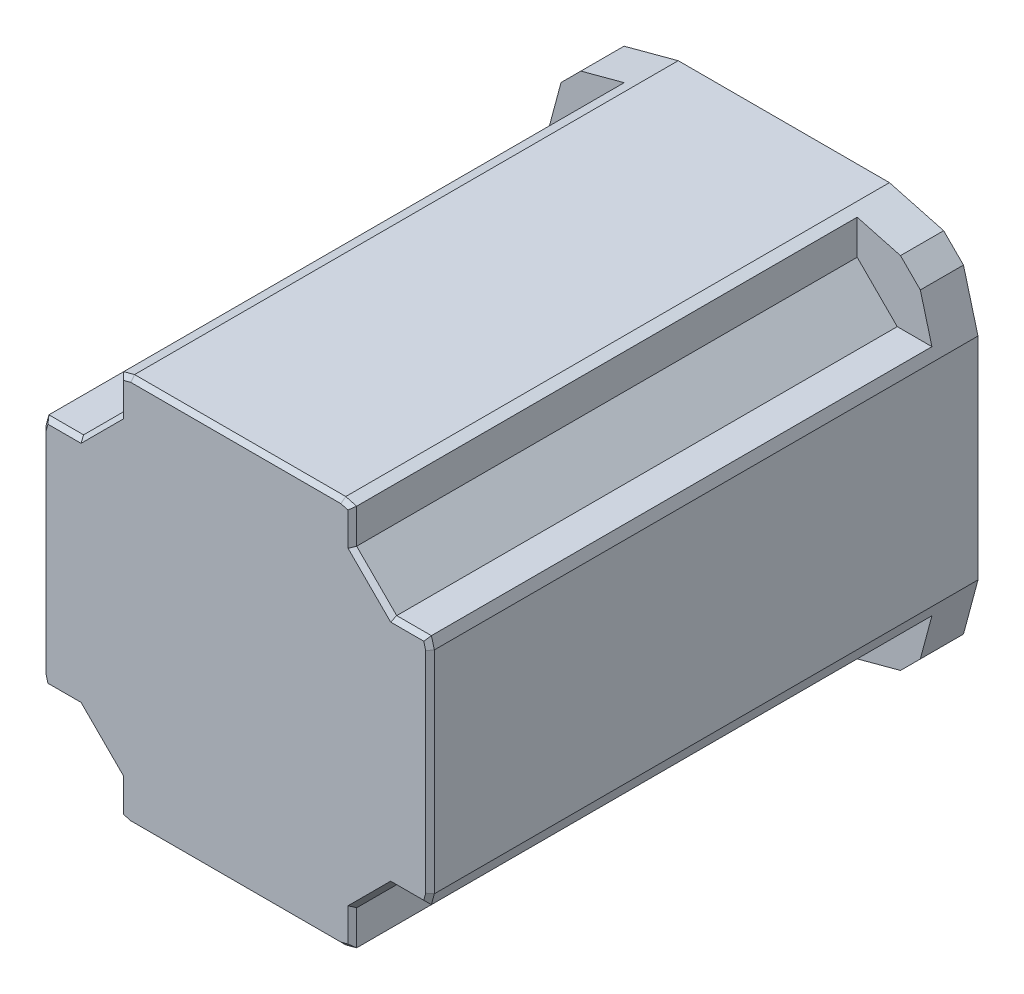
ISO-10303-21;
HEADER;
FILE_DESCRIPTION(('STEP AP214'),'2;1');
FILE_NAME('part.step','',(''),(''),'','','');
FILE_SCHEMA(('AUTOMOTIVE_DESIGN { 1 0 10303 214 1 1 1 1 }'));
ENDSEC;
DATA;
#1=APPLICATION_CONTEXT('core data for automotive mechanical design processes');
#2=APPLICATION_PROTOCOL_DEFINITION('international standard','automotive_design',2000,#1);
#3=PRODUCT_CONTEXT('',#1,'mechanical');
#4=PRODUCT('Part','Part','',(#3));
#5=PRODUCT_RELATED_PRODUCT_CATEGORY('part','',(#4));
#6=PRODUCT_DEFINITION_FORMATION('','',#4);
#7=PRODUCT_DEFINITION_CONTEXT('part definition',#1,'design');
#8=PRODUCT_DEFINITION('design','',#6,#7);
#9=PRODUCT_DEFINITION_SHAPE('','',#8);
#10=(LENGTH_UNIT() NAMED_UNIT(*) SI_UNIT(.MILLI.,.METRE.));
#11=(NAMED_UNIT(*) PLANE_ANGLE_UNIT() SI_UNIT($,.RADIAN.));
#12=(NAMED_UNIT(*) SI_UNIT($,.STERADIAN.) SOLID_ANGLE_UNIT());
#13=UNCERTAINTY_MEASURE_WITH_UNIT(LENGTH_MEASURE(1.E-05),#10,'distance_accuracy_value','');
#14=(GEOMETRIC_REPRESENTATION_CONTEXT(3) GLOBAL_UNCERTAINTY_ASSIGNED_CONTEXT((#13)) GLOBAL_UNIT_ASSIGNED_CONTEXT((#10,
#11,#12)) REPRESENTATION_CONTEXT('',''));
#15=CARTESIAN_POINT('',(0.,0.,0.));
#16=DIRECTION('',(0.,0.,1.));
#17=DIRECTION('',(1.,0.,0.));
#18=AXIS2_PLACEMENT_3D('',#15,#16,#17);
#19=CARTESIAN_POINT('',(5.60662307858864E-12,221.,425.999999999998));
#20=DIRECTION('',(0.,0.,-1.));
#21=DIRECTION('',(0.,1.,0.));
#22=AXIS2_PLACEMENT_3D('',#19,#20,#21);
#23=PLANE('',#22);
#24=CARTESIAN_POINT('',(5.60662307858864E-12,221.,425.999999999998));
#25=DIRECTION('',(0.,0.,-1.));
#26=DIRECTION('',(-1.,0.,0.));
#27=AXIS2_PLACEMENT_3D('',#24,#25,#26);
#28=CIRCLE('',#27,47.5);
#29=CARTESIAN_POINT('',(47.5000000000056,221.,425.999999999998));
#30=VERTEX_POINT('',#29);
#31=CARTESIAN_POINT('',(-47.4999999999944,221.,425.999999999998));
#32=VERTEX_POINT('',#31);
#33=EDGE_CURVE('E10',#30,#32,#28,.T.);
#34=ORIENTED_EDGE('',*,*,#33,.T.);
#35=CARTESIAN_POINT('',(5.60662307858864E-12,221.,425.999999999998));
#36=DIRECTION('',(0.,0.,-1.));
#37=DIRECTION('',(-1.,0.,0.));
#38=AXIS2_PLACEMENT_3D('',#35,#36,#37);
#39=CIRCLE('',#38,47.5);
#40=EDGE_CURVE('E25',#32,#30,#39,.T.);
#41=ORIENTED_EDGE('',*,*,#40,.T.);
#42=EDGE_LOOP('',(#34,#41));
#43=FACE_BOUND('',#42,.T.);
#44=ADVANCED_FACE('F15',(#43),#23,.T.);
#45=CARTESIAN_POINT('',(5.60663053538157E-12,221.,460.999999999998));
#46=DIRECTION('',(0.,0.,1.));
#47=DIRECTION('',(0.,-1.,0.));
#48=AXIS2_PLACEMENT_3D('',#45,#46,#47);
#49=PLANE('',#48);
#50=DIRECTION('',(0.707106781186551,0.707106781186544,0.));
#51=VECTOR('',#50,1.);
#52=CARTESIAN_POINT('',(74.0753257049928,137.732286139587,460.999999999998));
#53=LINE('',#52,#51);
#54=CARTESIAN_POINT('',(74.0753257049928,137.732286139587,460.999999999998));
#55=VERTEX_POINT('',#54);
#56=CARTESIAN_POINT('',(83.2677138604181,146.924674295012,460.999999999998));
#57=VERTEX_POINT('',#56);
#58=EDGE_CURVE('E502',#55,#57,#53,.T.);
#59=ORIENTED_EDGE('',*,*,#58,.T.);
#60=DIRECTION('',(0.258819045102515,0.96592582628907,0.));
#61=VECTOR('',#60,1.);
#62=CARTESIAN_POINT('',(90.0000000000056,172.049908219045,460.999999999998));
#63=LINE('',#62,#61);
#64=CARTESIAN_POINT('',(88.6468811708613,167.,460.999999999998));
#65=VERTEX_POINT('',#64);
#66=EDGE_CURVE('E505',#57,#65,#63,.T.);
#67=ORIENTED_EDGE('',*,*,#66,.T.);
#68=DIRECTION('',(1.,0.,0.));
#69=VECTOR('',#68,1.);
#70=CARTESIAN_POINT('',(90.0000000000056,167.,460.999999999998));
#71=LINE('',#70,#69);
#72=CARTESIAN_POINT('',(72.5721138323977,167.,460.999999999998));
#73=VERTEX_POINT('',#72);
#74=EDGE_CURVE('E460',#73,#65,#71,.T.);
#75=ORIENTED_EDGE('',*,*,#74,.F.);
#76=DIRECTION('',(0.707106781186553,0.707106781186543,0.));
#77=VECTOR('',#76,1.);
#78=CARTESIAN_POINT('',(54.0000000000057,148.427886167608,460.999999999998));
#79=LINE('',#78,#77);
#80=CARTESIAN_POINT('',(54.0000000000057,148.427886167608,460.999999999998));
#81=VERTEX_POINT('',#80);
#82=EDGE_CURVE('E443',#81,#73,#79,.T.);
#83=ORIENTED_EDGE('',*,*,#82,.F.);
#84=DIRECTION('',(0.,1.,0.));
#85=VECTOR('',#84,1.);
#86=CARTESIAN_POINT('',(54.0000000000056,131.,460.999999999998));
#87=LINE('',#86,#85);
#88=CARTESIAN_POINT('',(54.0000000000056,132.353118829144,460.999999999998));
#89=VERTEX_POINT('',#88);
#90=EDGE_CURVE('E586',#89,#81,#87,.T.);
#91=ORIENTED_EDGE('',*,*,#90,.F.);
#92=DIRECTION('',(0.965925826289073,0.258819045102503,0.));
#93=VECTOR('',#92,1.);
#94=CARTESIAN_POINT('',(48.9500917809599,131.,460.999999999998));
#95=LINE('',#94,#93);
#96=EDGE_CURVE('E537',#89,#55,#95,.T.);
#97=ORIENTED_EDGE('',*,*,#96,.T.);
#98=EDGE_LOOP('',(#59,#67,#75,#83,#91,#97));
#99=FACE_BOUND('',#98,.T.);
#100=ADVANCED_FACE('F784',(#99),#49,.T.);
#101=CARTESIAN_POINT('',(5.60663053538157E-12,221.,460.999999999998));
#102=DIRECTION('',(0.,0.,1.));
#103=DIRECTION('',(0.,-1.,0.));
#104=AXIS2_PLACEMENT_3D('',#101,#102,#103);
#105=PLANE('',#104);
#106=DIRECTION('',(-0.707106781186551,-0.707106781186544,0.));
#107=VECTOR('',#106,1.);
#108=CARTESIAN_POINT('',(-74.0753257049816,304.267713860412,460.999999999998));
#109=LINE('',#108,#107);
#110=CARTESIAN_POINT('',(-74.0753257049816,304.267713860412,460.999999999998));
#111=VERTEX_POINT('',#110);
#112=CARTESIAN_POINT('',(-83.2677138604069,295.075325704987,460.999999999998));
#113=VERTEX_POINT('',#112);
#114=EDGE_CURVE('E424',#111,#113,#109,.T.);
#115=ORIENTED_EDGE('',*,*,#114,.T.);
#116=DIRECTION('',(-0.258819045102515,-0.96592582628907,0.));
#117=VECTOR('',#116,1.);
#118=CARTESIAN_POINT('',(-89.9999999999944,269.950091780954,460.999999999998));
#119=LINE('',#118,#117);
#120=CARTESIAN_POINT('',(-88.6468811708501,274.999999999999,460.999999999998));
#121=VERTEX_POINT('',#120);
#122=EDGE_CURVE('E421',#113,#121,#119,.T.);
#123=ORIENTED_EDGE('',*,*,#122,.T.);
#124=DIRECTION('',(-1.,0.,0.));
#125=VECTOR('',#124,1.);
#126=CARTESIAN_POINT('',(-89.9999999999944,274.999999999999,460.999999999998));
#127=LINE('',#126,#125);
#128=CARTESIAN_POINT('',(-72.5721138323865,275.,460.999999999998));
#129=VERTEX_POINT('',#128);
#130=EDGE_CURVE('E466',#129,#121,#127,.T.);
#131=ORIENTED_EDGE('',*,*,#130,.F.);
#132=DIRECTION('',(-0.707106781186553,-0.707106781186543,0.));
#133=VECTOR('',#132,1.);
#134=CARTESIAN_POINT('',(-53.9999999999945,293.572113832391,460.999999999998));
#135=LINE('',#134,#133);
#136=CARTESIAN_POINT('',(-53.9999999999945,293.572113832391,460.999999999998));
#137=VERTEX_POINT('',#136);
#138=EDGE_CURVE('E474',#137,#129,#135,.T.);
#139=ORIENTED_EDGE('',*,*,#138,.F.);
#140=DIRECTION('',(0.,-1.,0.));
#141=VECTOR('',#140,1.);
#142=CARTESIAN_POINT('',(-53.9999999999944,311.,460.999999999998));
#143=LINE('',#142,#141);
#144=CARTESIAN_POINT('',(-53.9999999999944,309.646881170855,460.999999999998));
#145=VERTEX_POINT('',#144);
#146=EDGE_CURVE('E417',#145,#137,#143,.T.);
#147=ORIENTED_EDGE('',*,*,#146,.F.);
#148=DIRECTION('',(-0.965925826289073,-0.258819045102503,0.));
#149=VECTOR('',#148,1.);
#150=CARTESIAN_POINT('',(-48.9500917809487,311.,460.999999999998));
#151=LINE('',#150,#149);
#152=EDGE_CURVE('E347',#145,#111,#151,.T.);
#153=ORIENTED_EDGE('',*,*,#152,.T.);
#154=EDGE_LOOP('',(#115,#123,#131,#139,#147,#153));
#155=FACE_BOUND('',#154,.T.);
#156=ADVANCED_FACE('F732',(#155),#105,.T.);
#157=CARTESIAN_POINT('',(5.60663053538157E-12,221.,460.999999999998));
#158=DIRECTION('',(0.,0.,1.));
#159=DIRECTION('',(0.,-1.,0.));
#160=AXIS2_PLACEMENT_3D('',#157,#158,#159);
#161=PLANE('',#160);
#162=DIRECTION('',(0.707106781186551,-0.707106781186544,0.));
#163=VECTOR('',#162,1.);
#164=CARTESIAN_POINT('',(74.0753257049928,304.267713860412,460.999999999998));
#165=LINE('',#164,#163);
#166=CARTESIAN_POINT('',(74.0753257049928,304.267713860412,460.999999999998));
#167=VERTEX_POINT('',#166);
#168=CARTESIAN_POINT('',(83.2677138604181,295.075325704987,460.999999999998));
#169=VERTEX_POINT('',#168);
#170=EDGE_CURVE('E551',#167,#169,#165,.T.);
#171=ORIENTED_EDGE('',*,*,#170,.F.);
#172=DIRECTION('',(0.965925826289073,-0.258819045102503,0.));
#173=VECTOR('',#172,1.);
#174=CARTESIAN_POINT('',(48.9500917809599,311.,460.999999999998));
#175=LINE('',#174,#173);
#176=CARTESIAN_POINT('',(54.0000000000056,309.646881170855,460.999999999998));
#177=VERTEX_POINT('',#176);
#178=EDGE_CURVE('E589',#177,#167,#175,.T.);
#179=ORIENTED_EDGE('',*,*,#178,.F.);
#180=DIRECTION('',(0.,-1.,0.));
#181=VECTOR('',#180,1.);
#182=CARTESIAN_POINT('',(54.0000000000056,311.,460.999999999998));
#183=LINE('',#182,#181);
#184=CARTESIAN_POINT('',(54.0000000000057,293.572113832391,460.999999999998));
#185=VERTEX_POINT('',#184);
#186=EDGE_CURVE('E344',#177,#185,#183,.T.);
#187=ORIENTED_EDGE('',*,*,#186,.T.);
#188=DIRECTION('',(0.707106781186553,-0.707106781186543,0.));
#189=VECTOR('',#188,1.);
#190=CARTESIAN_POINT('',(54.0000000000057,293.572113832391,460.999999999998));
#191=LINE('',#190,#189);
#192=CARTESIAN_POINT('',(72.5721138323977,275.,460.999999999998));
#193=VERTEX_POINT('',#192);
#194=EDGE_CURVE('E348',#185,#193,#191,.T.);
#195=ORIENTED_EDGE('',*,*,#194,.T.);
#196=DIRECTION('',(1.,0.,0.));
#197=VECTOR('',#196,1.);
#198=CARTESIAN_POINT('',(90.0000000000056,274.999999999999,460.999999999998));
#199=LINE('',#198,#197);
#200=CARTESIAN_POINT('',(88.6468811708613,274.999999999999,460.999999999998));
#201=VERTEX_POINT('',#200);
#202=EDGE_CURVE('E415',#193,#201,#199,.T.);
#203=ORIENTED_EDGE('',*,*,#202,.T.);
#204=DIRECTION('',(0.258819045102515,-0.96592582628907,0.));
#205=VECTOR('',#204,1.);
#206=CARTESIAN_POINT('',(90.0000000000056,269.950091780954,460.999999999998));
#207=LINE('',#206,#205);
#208=EDGE_CURVE('E494',#169,#201,#207,.T.);
#209=ORIENTED_EDGE('',*,*,#208,.F.);
#210=EDGE_LOOP('',(#171,#179,#187,#195,#203,#209));
#211=FACE_BOUND('',#210,.T.);
#212=ADVANCED_FACE('F853',(#211),#161,.T.);
#213=CARTESIAN_POINT('',(5.60662627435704E-12,221.,425.999999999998));
#214=DIRECTION('',(0.,0.,1.));
#215=DIRECTION('',(0.,-1.,0.));
#216=AXIS2_PLACEMENT_3D('',#213,#214,#215);
#217=CYLINDRICAL_SURFACE('',#216,47.5);
#218=DIRECTION('',(0.,0.,1.));
#219=VECTOR('',#218,1.);
#220=CARTESIAN_POINT('',(-47.4999999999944,221.,425.999999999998));
#221=LINE('',#220,#219);
#222=CARTESIAN_POINT('',(-47.4999999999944,221.,440.999999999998));
#223=VERTEX_POINT('',#222);
#224=EDGE_CURVE('E34',#32,#223,#221,.T.);
#225=ORIENTED_EDGE('',*,*,#224,.F.);
#226=ORIENTED_EDGE('',*,*,#33,.F.);
#227=DIRECTION('',(0.,0.,1.));
#228=VECTOR('',#227,1.);
#229=CARTESIAN_POINT('',(47.5000000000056,221.,425.999999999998));
#230=LINE('',#229,#228);
#231=CARTESIAN_POINT('',(47.5000000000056,221.,440.999999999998));
#232=VERTEX_POINT('',#231);
#233=EDGE_CURVE('E412',#30,#232,#230,.T.);
#234=ORIENTED_EDGE('',*,*,#233,.T.);
#235=CARTESIAN_POINT('',(5.60662627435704E-12,221.,440.999999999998));
#236=DIRECTION('',(0.,0.,-1.));
#237=DIRECTION('',(-1.,0.,0.));
#238=AXIS2_PLACEMENT_3D('',#235,#236,#237);
#239=CIRCLE('',#238,47.5);
#240=EDGE_CURVE('E416',#232,#223,#239,.T.);
#241=ORIENTED_EDGE('',*,*,#240,.T.);
#242=EDGE_LOOP('',(#225,#226,#234,#241));
#243=FACE_BOUND('',#242,.T.);
#244=ADVANCED_FACE('F840',(#243),#217,.T.);
#245=CARTESIAN_POINT('',(5.60662627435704E-12,221.,425.999999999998));
#246=DIRECTION('',(0.,0.,1.));
#247=DIRECTION('',(0.,-1.,0.));
#248=AXIS2_PLACEMENT_3D('',#245,#246,#247);
#249=CYLINDRICAL_SURFACE('',#248,47.5);
#250=ORIENTED_EDGE('',*,*,#40,.F.);
#251=ORIENTED_EDGE('',*,*,#224,.T.);
#252=CARTESIAN_POINT('',(5.60662627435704E-12,221.,440.999999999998));
#253=DIRECTION('',(0.,0.,-1.));
#254=DIRECTION('',(-1.,0.,0.));
#255=AXIS2_PLACEMENT_3D('',#252,#253,#254);
#256=CIRCLE('',#255,47.5);
#257=EDGE_CURVE('E428',#223,#232,#256,.T.);
#258=ORIENTED_EDGE('',*,*,#257,.T.);
#259=ORIENTED_EDGE('',*,*,#233,.F.);
#260=EDGE_LOOP('',(#250,#251,#258,#259));
#261=FACE_BOUND('',#260,.T.);
#262=ADVANCED_FACE('F17',(#261),#249,.T.);
#263=CARTESIAN_POINT('',(-74.0753257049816,304.267713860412,694.999999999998));
#264=DIRECTION('',(-0.707106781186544,0.707106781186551,0.));
#265=DIRECTION('',(-0.707106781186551,-0.707106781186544,0.));
#266=AXIS2_PLACEMENT_3D('',#263,#264,#265);
#267=PLANE('',#266);
#268=DIRECTION('',(0.,0.,-1.));
#269=VECTOR('',#268,1.);
#270=CARTESIAN_POINT('',(-74.0753257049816,304.267713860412,694.999999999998));
#271=LINE('',#270,#269);
#272=CARTESIAN_POINT('',(-74.0753257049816,304.267713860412,440.999999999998));
#273=VERTEX_POINT('',#272);
#274=EDGE_CURVE('E430',#111,#273,#271,.T.);
#275=ORIENTED_EDGE('',*,*,#274,.T.);
#276=DIRECTION('',(0.707106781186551,0.707106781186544,0.));
#277=VECTOR('',#276,1.);
#278=CARTESIAN_POINT('',(-74.0753257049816,304.267713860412,440.999999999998));
#279=LINE('',#278,#277);
#280=CARTESIAN_POINT('',(-83.2677138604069,295.075325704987,440.999999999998));
#281=VERTEX_POINT('',#280);
#282=EDGE_CURVE('E560',#281,#273,#279,.T.);
#283=ORIENTED_EDGE('',*,*,#282,.F.);
#284=DIRECTION('',(0.,0.,-1.));
#285=VECTOR('',#284,1.);
#286=CARTESIAN_POINT('',(-83.2677138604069,295.075325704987,694.999999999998));
#287=LINE('',#286,#285);
#288=EDGE_CURVE('E627',#113,#281,#287,.T.);
#289=ORIENTED_EDGE('',*,*,#288,.F.);
#290=ORIENTED_EDGE('',*,*,#114,.F.);
#291=EDGE_LOOP('',(#275,#283,#289,#290));
#292=FACE_BOUND('',#291,.T.);
#293=ADVANCED_FACE('F830',(#292),#267,.T.);
#294=CARTESIAN_POINT('',(74.0753257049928,304.267713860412,694.999999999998));
#295=DIRECTION('',(0.707106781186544,0.707106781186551,0.));
#296=DIRECTION('',(-0.707106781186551,0.707106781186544,0.));
#297=AXIS2_PLACEMENT_3D('',#294,#295,#296);
#298=PLANE('',#297);
#299=DIRECTION('',(0.,0.,-1.));
#300=VECTOR('',#299,1.);
#301=CARTESIAN_POINT('',(74.0753257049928,304.267713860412,694.999999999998));
#302=LINE('',#301,#300);
#303=CARTESIAN_POINT('',(74.0753257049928,304.267713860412,440.999999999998));
#304=VERTEX_POINT('',#303);
#305=EDGE_CURVE('E490',#167,#304,#302,.T.);
#306=ORIENTED_EDGE('',*,*,#305,.F.);
#307=ORIENTED_EDGE('',*,*,#170,.T.);
#308=DIRECTION('',(0.,0.,-1.));
#309=VECTOR('',#308,1.);
#310=CARTESIAN_POINT('',(83.2677138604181,295.075325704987,694.999999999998));
#311=LINE('',#310,#309);
#312=CARTESIAN_POINT('',(83.2677138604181,295.075325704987,440.999999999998));
#313=VERTEX_POINT('',#312);
#314=EDGE_CURVE('E379',#169,#313,#311,.T.);
#315=ORIENTED_EDGE('',*,*,#314,.T.);
#316=DIRECTION('',(-0.707106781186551,0.707106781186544,0.));
#317=VECTOR('',#316,1.);
#318=CARTESIAN_POINT('',(74.0753257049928,304.267713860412,440.999999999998));
#319=LINE('',#318,#317);
#320=EDGE_CURVE('E376',#313,#304,#319,.T.);
#321=ORIENTED_EDGE('',*,*,#320,.T.);
#322=EDGE_LOOP('',(#306,#307,#315,#321));
#323=FACE_BOUND('',#322,.T.);
#324=ADVANCED_FACE('F764',(#323),#298,.T.);
#325=CARTESIAN_POINT('',(74.0753257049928,137.732286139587,694.999999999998));
#326=DIRECTION('',(0.707106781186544,-0.707106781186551,0.));
#327=DIRECTION('',(0.707106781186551,0.707106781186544,0.));
#328=AXIS2_PLACEMENT_3D('',#325,#326,#327);
#329=PLANE('',#328);
#330=DIRECTION('',(0.,0.,-1.));
#331=VECTOR('',#330,1.);
#332=CARTESIAN_POINT('',(74.0753257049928,137.732286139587,694.999999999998));
#333=LINE('',#332,#331);
#334=CARTESIAN_POINT('',(74.0753257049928,137.732286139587,440.999999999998));
#335=VERTEX_POINT('',#334);
#336=EDGE_CURVE('E380',#55,#335,#333,.T.);
#337=ORIENTED_EDGE('',*,*,#336,.T.);
#338=DIRECTION('',(-0.707106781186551,-0.707106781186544,0.));
#339=VECTOR('',#338,1.);
#340=CARTESIAN_POINT('',(74.0753257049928,137.732286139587,440.999999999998));
#341=LINE('',#340,#339);
#342=CARTESIAN_POINT('',(83.2677138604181,146.924674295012,440.999999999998));
#343=VERTEX_POINT('',#342);
#344=EDGE_CURVE('E381',#343,#335,#341,.T.);
#345=ORIENTED_EDGE('',*,*,#344,.F.);
#346=DIRECTION('',(0.,0.,-1.));
#347=VECTOR('',#346,1.);
#348=CARTESIAN_POINT('',(83.2677138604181,146.924674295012,694.999999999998));
#349=LINE('',#348,#347);
#350=EDGE_CURVE('E371',#57,#343,#349,.T.);
#351=ORIENTED_EDGE('',*,*,#350,.F.);
#352=ORIENTED_EDGE('',*,*,#58,.F.);
#353=EDGE_LOOP('',(#337,#345,#351,#352));
#354=FACE_BOUND('',#353,.T.);
#355=ADVANCED_FACE('F782',(#354),#329,.T.);
#356=CARTESIAN_POINT('',(-53.9999999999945,293.572113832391,390.088311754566));
#357=DIRECTION('',(-0.707106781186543,0.707106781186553,0.));
#358=DIRECTION('',(-0.707106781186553,-0.707106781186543,0.));
#359=AXIS2_PLACEMENT_3D('',#356,#357,#358);
#360=PLANE('',#359);
#361=DIRECTION('',(0.,0.,1.));
#362=VECTOR('',#361,1.);
#363=CARTESIAN_POINT('',(-72.5721138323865,275.,390.088311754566));
#364=LINE('',#363,#362);
#365=CARTESIAN_POINT('',(-72.5721138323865,275.,692.999999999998));
#366=VERTEX_POINT('',#365);
#367=EDGE_CURVE('E649',#129,#366,#364,.T.);
#368=ORIENTED_EDGE('',*,*,#367,.T.);
#369=DIRECTION('',(0.707106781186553,0.707106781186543,0.));
#370=VECTOR('',#369,1.);
#371=CARTESIAN_POINT('',(-53.9999999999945,293.572113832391,692.999999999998));
#372=LINE('',#371,#370);
#373=CARTESIAN_POINT('',(-53.9999999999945,293.572113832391,692.999999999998));
#374=VERTEX_POINT('',#373);
#375=EDGE_CURVE('E477',#366,#374,#372,.T.);
#376=ORIENTED_EDGE('',*,*,#375,.T.);
#377=DIRECTION('',(0.,0.,1.));
#378=VECTOR('',#377,1.);
#379=CARTESIAN_POINT('',(-53.9999999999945,293.572113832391,390.088311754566));
#380=LINE('',#379,#378);
#381=EDGE_CURVE('E375',#137,#374,#380,.T.);
#382=ORIENTED_EDGE('',*,*,#381,.F.);
#383=ORIENTED_EDGE('',*,*,#138,.T.);
#384=EDGE_LOOP('',(#368,#376,#382,#383));
#385=FACE_BOUND('',#384,.T.);
#386=ADVANCED_FACE('F736',(#385),#360,.T.);
#387=CARTESIAN_POINT('',(90.0000000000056,269.950091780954,694.999999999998));
#388=DIRECTION('',(1.,0.,0.));
#389=DIRECTION('',(0.,0.,-1.));
#390=AXIS2_PLACEMENT_3D('',#387,#388,#389);
#391=PLANE('',#390);
#392=DIRECTION('',(0.,0.,-1.));
#393=VECTOR('',#392,1.);
#394=CARTESIAN_POINT('',(90.0000000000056,269.950091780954,694.999999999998));
#395=LINE('',#394,#393);
#396=CARTESIAN_POINT('',(90.0000000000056,269.950091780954,692.999999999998));
#397=VERTEX_POINT('',#396);
#398=CARTESIAN_POINT('',(90.0000000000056,269.950091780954,440.999999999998));
#399=VERTEX_POINT('',#398);
#400=EDGE_CURVE('E611',#397,#399,#395,.T.);
#401=ORIENTED_EDGE('',*,*,#400,.F.);
#402=DIRECTION('',(0.,-1.,0.));
#403=VECTOR('',#402,1.);
#404=CARTESIAN_POINT('',(90.0000000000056,269.950091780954,692.999999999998));
#405=LINE('',#404,#403);
#406=CARTESIAN_POINT('',(90.0000000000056,172.049908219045,692.999999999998));
#407=VERTEX_POINT('',#406);
#408=EDGE_CURVE('E478',#397,#407,#405,.T.);
#409=ORIENTED_EDGE('',*,*,#408,.T.);
#410=DIRECTION('',(0.,0.,-1.));
#411=VECTOR('',#410,1.);
#412=CARTESIAN_POINT('',(90.0000000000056,172.049908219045,694.999999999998));
#413=LINE('',#412,#411);
#414=CARTESIAN_POINT('',(90.0000000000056,172.049908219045,440.999999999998));
#415=VERTEX_POINT('',#414);
#416=EDGE_CURVE('E571',#407,#415,#413,.T.);
#417=ORIENTED_EDGE('',*,*,#416,.T.);
#418=DIRECTION('',(0.,1.,0.));
#419=VECTOR('',#418,1.);
#420=CARTESIAN_POINT('',(90.0000000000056,269.950091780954,440.999999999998));
#421=LINE('',#420,#419);
#422=EDGE_CURVE('E604',#415,#399,#421,.T.);
#423=ORIENTED_EDGE('',*,*,#422,.T.);
#424=EDGE_LOOP('',(#401,#409,#417,#423));
#425=FACE_BOUND('',#424,.T.);
#426=ADVANCED_FACE('F774',(#425),#391,.T.);
#427=CARTESIAN_POINT('',(54.0000000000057,293.572113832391,390.088311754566));
#428=DIRECTION('',(0.707106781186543,0.707106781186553,0.));
#429=DIRECTION('',(-0.707106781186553,0.707106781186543,0.));
#430=AXIS2_PLACEMENT_3D('',#427,#428,#429);
#431=PLANE('',#430);
#432=DIRECTION('',(0.,0.,1.));
#433=VECTOR('',#432,1.);
#434=CARTESIAN_POINT('',(54.0000000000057,293.572113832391,390.088311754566));
#435=LINE('',#434,#433);
#436=CARTESIAN_POINT('',(54.0000000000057,293.572113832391,692.999999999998));
#437=VERTEX_POINT('',#436);
#438=EDGE_CURVE('E607',#185,#437,#435,.T.);
#439=ORIENTED_EDGE('',*,*,#438,.T.);
#440=DIRECTION('',(0.707106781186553,-0.707106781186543,0.));
#441=VECTOR('',#440,1.);
#442=CARTESIAN_POINT('',(54.0000000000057,293.572113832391,692.999999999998));
#443=LINE('',#442,#441);
#444=CARTESIAN_POINT('',(72.5721138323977,275.,692.999999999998));
#445=VERTEX_POINT('',#444);
#446=EDGE_CURVE('E388',#437,#445,#443,.T.);
#447=ORIENTED_EDGE('',*,*,#446,.T.);
#448=DIRECTION('',(0.,0.,1.));
#449=VECTOR('',#448,1.);
#450=CARTESIAN_POINT('',(72.5721138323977,275.,390.088311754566));
#451=LINE('',#450,#449);
#452=EDGE_CURVE('E447',#193,#445,#451,.T.);
#453=ORIENTED_EDGE('',*,*,#452,.F.);
#454=ORIENTED_EDGE('',*,*,#194,.F.);
#455=EDGE_LOOP('',(#439,#447,#453,#454));
#456=FACE_BOUND('',#455,.T.);
#457=ADVANCED_FACE('F1287',(#456),#431,.T.);
#458=CARTESIAN_POINT('',(5.6066803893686E-12,311.,694.999999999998));
#459=DIRECTION('',(0.,1.,0.));
#460=DIRECTION('',(0.,0.,1.));
#461=AXIS2_PLACEMENT_3D('',#458,#459,#460);
#462=PLANE('',#461);
#463=DIRECTION('',(0.,0.,-1.));
#464=VECTOR('',#463,1.);
#465=CARTESIAN_POINT('',(-48.9500917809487,311.,694.999999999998));
#466=LINE('',#465,#464);
#467=CARTESIAN_POINT('',(-48.9500917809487,311.,692.999999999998));
#468=VERTEX_POINT('',#467);
#469=CARTESIAN_POINT('',(-48.9500917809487,311.,440.999999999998));
#470=VERTEX_POINT('',#469);
#471=EDGE_CURVE('E351',#468,#470,#466,.T.);
#472=ORIENTED_EDGE('',*,*,#471,.F.);
#473=DIRECTION('',(1.,0.,0.));
#474=VECTOR('',#473,1.);
#475=CARTESIAN_POINT('',(5.60667996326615E-12,311.,692.999999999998));
#476=LINE('',#475,#474);
#477=CARTESIAN_POINT('',(48.9500917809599,311.,692.999999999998));
#478=VERTEX_POINT('',#477);
#479=EDGE_CURVE('E385',#468,#478,#476,.T.);
#480=ORIENTED_EDGE('',*,*,#479,.T.);
#481=DIRECTION('',(0.,0.,-1.));
#482=VECTOR('',#481,1.);
#483=CARTESIAN_POINT('',(48.9500917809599,311.,694.999999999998));
#484=LINE('',#483,#482);
#485=CARTESIAN_POINT('',(48.9500917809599,311.,440.999999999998));
#486=VERTEX_POINT('',#485);
#487=EDGE_CURVE('E389',#478,#486,#484,.T.);
#488=ORIENTED_EDGE('',*,*,#487,.T.);
#489=DIRECTION('',(-1.,0.,0.));
#490=VECTOR('',#489,1.);
#491=CARTESIAN_POINT('',(5.60662627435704E-12,311.,440.999999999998));
#492=LINE('',#491,#490);
#493=EDGE_CURVE('E483',#486,#470,#492,.T.);
#494=ORIENTED_EDGE('',*,*,#493,.T.);
#495=EDGE_LOOP('',(#472,#480,#488,#494));
#496=FACE_BOUND('',#495,.T.);
#497=ADVANCED_FACE('F754',(#496),#462,.T.);
#498=CARTESIAN_POINT('',(48.9500917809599,131.,694.999999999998));
#499=DIRECTION('',(0.258819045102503,-0.965925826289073,0.));
#500=DIRECTION('',(0.965925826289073,0.258819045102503,0.));
#501=AXIS2_PLACEMENT_3D('',#498,#499,#500);
#502=PLANE('',#501);
#503=DIRECTION('',(0.,0.,-1.));
#504=VECTOR('',#503,1.);
#505=CARTESIAN_POINT('',(54.0000000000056,132.353118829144,694.999999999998));
#506=LINE('',#505,#504);
#507=CARTESIAN_POINT('',(54.0000000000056,132.353118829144,692.999999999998));
#508=VERTEX_POINT('',#507);
#509=EDGE_CURVE('E583',#508,#89,#506,.T.);
#510=ORIENTED_EDGE('',*,*,#509,.F.);
#511=DIRECTION('',(-0.965925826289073,-0.258819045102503,0.));
#512=VECTOR('',#511,1.);
#513=CARTESIAN_POINT('',(48.9500917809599,131.,692.999999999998));
#514=LINE('',#513,#512);
#515=CARTESIAN_POINT('',(48.9500917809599,131.,692.999999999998));
#516=VERTEX_POINT('',#515);
#517=EDGE_CURVE('E511',#508,#516,#514,.T.);
#518=ORIENTED_EDGE('',*,*,#517,.T.);
#519=DIRECTION('',(0.,0.,-1.));
#520=VECTOR('',#519,1.);
#521=CARTESIAN_POINT('',(48.9500917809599,131.,694.999999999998));
#522=LINE('',#521,#520);
#523=CARTESIAN_POINT('',(48.9500917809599,131.,440.999999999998));
#524=VERTEX_POINT('',#523);
#525=EDGE_CURVE('E508',#516,#524,#522,.T.);
#526=ORIENTED_EDGE('',*,*,#525,.T.);
#527=DIRECTION('',(-0.965925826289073,-0.258819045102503,0.));
#528=VECTOR('',#527,1.);
#529=CARTESIAN_POINT('',(48.9500917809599,131.,440.999999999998));
#530=LINE('',#529,#528);
#531=EDGE_CURVE('E384',#335,#524,#530,.T.);
#532=ORIENTED_EDGE('',*,*,#531,.F.);
#533=ORIENTED_EDGE('',*,*,#336,.F.);
#534=ORIENTED_EDGE('',*,*,#96,.F.);
#535=EDGE_LOOP('',(#510,#518,#526,#532,#533,#534));
#536=FACE_BOUND('',#535,.T.);
#537=ADVANCED_FACE('F789',(#536),#502,.T.);
#538=CARTESIAN_POINT('',(-48.9500917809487,311.,694.999999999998));
#539=DIRECTION('',(-0.258819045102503,0.965925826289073,0.));
#540=DIRECTION('',(-0.965925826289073,-0.258819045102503,0.));
#541=AXIS2_PLACEMENT_3D('',#538,#539,#540);
#542=PLANE('',#541);
#543=DIRECTION('',(0.,0.,-1.));
#544=VECTOR('',#543,1.);
#545=CARTESIAN_POINT('',(-53.9999999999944,309.646881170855,694.999999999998));
#546=LINE('',#545,#544);
#547=CARTESIAN_POINT('',(-53.9999999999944,309.646881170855,692.999999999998));
#548=VERTEX_POINT('',#547);
#549=EDGE_CURVE('E419',#548,#145,#546,.T.);
#550=ORIENTED_EDGE('',*,*,#549,.F.);
#551=DIRECTION('',(0.965925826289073,0.258819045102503,0.));
#552=VECTOR('',#551,1.);
#553=CARTESIAN_POINT('',(-48.9500917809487,311.,692.999999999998));
#554=LINE('',#553,#552);
#555=EDGE_CURVE('E512',#548,#468,#554,.T.);
#556=ORIENTED_EDGE('',*,*,#555,.T.);
#557=ORIENTED_EDGE('',*,*,#471,.T.);
#558=DIRECTION('',(0.965925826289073,0.258819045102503,0.));
#559=VECTOR('',#558,1.);
#560=CARTESIAN_POINT('',(-48.9500917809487,311.,440.999999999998));
#561=LINE('',#560,#559);
#562=EDGE_CURVE('E564',#273,#470,#561,.T.);
#563=ORIENTED_EDGE('',*,*,#562,.F.);
#564=ORIENTED_EDGE('',*,*,#274,.F.);
#565=ORIENTED_EDGE('',*,*,#152,.F.);
#566=EDGE_LOOP('',(#550,#556,#557,#563,#564,#565));
#567=FACE_BOUND('',#566,.T.);
#568=ADVANCED_FACE('F729',(#567),#542,.T.);
#569=CARTESIAN_POINT('',(54.0000000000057,148.427886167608,390.088311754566));
#570=DIRECTION('',(0.707106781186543,-0.707106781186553,0.));
#571=DIRECTION('',(0.707106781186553,0.707106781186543,0.));
#572=AXIS2_PLACEMENT_3D('',#569,#570,#571);
#573=PLANE('',#572);
#574=DIRECTION('',(0.,0.,1.));
#575=VECTOR('',#574,1.);
#576=CARTESIAN_POINT('',(72.5721138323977,167.,390.088311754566));
#577=LINE('',#576,#575);
#578=CARTESIAN_POINT('',(72.5721138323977,167.,692.999999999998));
#579=VERTEX_POINT('',#578);
#580=EDGE_CURVE('E349',#73,#579,#577,.T.);
#581=ORIENTED_EDGE('',*,*,#580,.T.);
#582=DIRECTION('',(-0.707106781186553,-0.707106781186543,0.));
#583=VECTOR('',#582,1.);
#584=CARTESIAN_POINT('',(54.0000000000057,148.427886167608,692.999999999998));
#585=LINE('',#584,#583);
#586=CARTESIAN_POINT('',(54.0000000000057,148.427886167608,692.999999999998));
#587=VERTEX_POINT('',#586);
#588=EDGE_CURVE('E324',#579,#587,#585,.T.);
#589=ORIENTED_EDGE('',*,*,#588,.T.);
#590=DIRECTION('',(0.,0.,1.));
#591=VECTOR('',#590,1.);
#592=CARTESIAN_POINT('',(54.0000000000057,148.427886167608,390.088311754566));
#593=LINE('',#592,#591);
#594=EDGE_CURVE('E446',#81,#587,#593,.T.);
#595=ORIENTED_EDGE('',*,*,#594,.F.);
#596=ORIENTED_EDGE('',*,*,#82,.T.);
#597=EDGE_LOOP('',(#581,#589,#595,#596));
#598=FACE_BOUND('',#597,.T.);
#599=ADVANCED_FACE('F880',(#598),#573,.T.);
#600=CARTESIAN_POINT('',(54.0000000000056,131.,390.088311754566));
#601=DIRECTION('',(1.,0.,0.));
#602=DIRECTION('',(0.,1.,0.));
#603=AXIS2_PLACEMENT_3D('',#600,#601,#602);
#604=PLANE('',#603);
#605=ORIENTED_EDGE('',*,*,#594,.T.);
#606=DIRECTION('',(0.,-1.,0.));
#607=VECTOR('',#606,1.);
#608=CARTESIAN_POINT('',(54.0000000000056,131.,692.999999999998));
#609=LINE('',#608,#607);
#610=EDGE_CURVE('E534',#587,#508,#609,.T.);
#611=ORIENTED_EDGE('',*,*,#610,.T.);
#612=ORIENTED_EDGE('',*,*,#509,.T.);
#613=ORIENTED_EDGE('',*,*,#90,.T.);
#614=EDGE_LOOP('',(#605,#611,#612,#613));
#615=FACE_BOUND('',#614,.T.);
#616=ADVANCED_FACE('F792',(#615),#604,.T.);
#617=CARTESIAN_POINT('',(54.0000000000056,311.,390.088311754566));
#618=DIRECTION('',(1.,0.,0.));
#619=DIRECTION('',(0.,0.,-1.));
#620=AXIS2_PLACEMENT_3D('',#617,#618,#619);
#621=PLANE('',#620);
#622=DIRECTION('',(0.,0.,-1.));
#623=VECTOR('',#622,1.);
#624=CARTESIAN_POINT('',(54.0000000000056,309.646881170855,694.999999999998));
#625=LINE('',#624,#623);
#626=CARTESIAN_POINT('',(54.0000000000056,309.646881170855,692.999999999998));
#627=VERTEX_POINT('',#626);
#628=EDGE_CURVE('E622',#627,#177,#625,.T.);
#629=ORIENTED_EDGE('',*,*,#628,.F.);
#630=DIRECTION('',(0.,-1.,0.));
#631=VECTOR('',#630,1.);
#632=CARTESIAN_POINT('',(54.0000000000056,311.,692.999999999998));
#633=LINE('',#632,#631);
#634=EDGE_CURVE('E610',#627,#437,#633,.T.);
#635=ORIENTED_EDGE('',*,*,#634,.T.);
#636=ORIENTED_EDGE('',*,*,#438,.F.);
#637=ORIENTED_EDGE('',*,*,#186,.F.);
#638=EDGE_LOOP('',(#629,#635,#636,#637));
#639=FACE_BOUND('',#638,.T.);
#640=ADVANCED_FACE('F888',(#639),#621,.T.);
#641=CARTESIAN_POINT('',(90.0000000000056,167.,390.088311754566));
#642=DIRECTION('',(0.,-1.,0.));
#643=DIRECTION('',(1.,0.,0.));
#644=AXIS2_PLACEMENT_3D('',#641,#642,#643);
#645=PLANE('',#644);
#646=DIRECTION('',(0.,0.,1.));
#647=VECTOR('',#646,1.);
#648=CARTESIAN_POINT('',(88.6468811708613,167.,694.999999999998));
#649=LINE('',#648,#647);
#650=CARTESIAN_POINT('',(88.6468811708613,167.,692.999999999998));
#651=VERTEX_POINT('',#650);
#652=EDGE_CURVE('E459',#65,#651,#649,.T.);
#653=ORIENTED_EDGE('',*,*,#652,.T.);
#654=DIRECTION('',(-1.,0.,0.));
#655=VECTOR('',#654,1.);
#656=CARTESIAN_POINT('',(90.0000000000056,167.,692.999999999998));
#657=LINE('',#656,#655);
#658=EDGE_CURVE('E456',#651,#579,#657,.T.);
#659=ORIENTED_EDGE('',*,*,#658,.T.);
#660=ORIENTED_EDGE('',*,*,#580,.F.);
#661=ORIENTED_EDGE('',*,*,#74,.T.);
#662=EDGE_LOOP('',(#653,#659,#660,#661));
#663=FACE_BOUND('',#662,.T.);
#664=ADVANCED_FACE('F877',(#663),#645,.T.);
#665=CARTESIAN_POINT('',(-89.9999999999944,167.,390.088311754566));
#666=DIRECTION('',(0.,-1.,0.));
#667=DIRECTION('',(1.,0.,0.));
#668=AXIS2_PLACEMENT_3D('',#665,#666,#667);
#669=PLANE('',#668);
#670=DIRECTION('',(0.,0.,1.));
#671=VECTOR('',#670,1.);
#672=CARTESIAN_POINT('',(-72.5721138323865,167.,390.088311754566));
#673=LINE('',#672,#671);
#674=CARTESIAN_POINT('',(-72.5721138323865,167.,460.999999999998));
#675=VERTEX_POINT('',#674);
#676=CARTESIAN_POINT('',(-72.5721138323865,167.,692.999999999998));
#677=VERTEX_POINT('',#676);
#678=EDGE_CURVE('E574',#675,#677,#673,.T.);
#679=ORIENTED_EDGE('',*,*,#678,.T.);
#680=DIRECTION('',(-1.,0.,0.));
#681=VECTOR('',#680,1.);
#682=CARTESIAN_POINT('',(-89.9999999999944,167.,692.999999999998));
#683=LINE('',#682,#681);
#684=CARTESIAN_POINT('',(-88.6468811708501,167.,692.999999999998));
#685=VERTEX_POINT('',#684);
#686=EDGE_CURVE('E450',#677,#685,#683,.T.);
#687=ORIENTED_EDGE('',*,*,#686,.T.);
#688=DIRECTION('',(0.,0.,1.));
#689=VECTOR('',#688,1.);
#690=CARTESIAN_POINT('',(-88.6468811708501,167.,694.999999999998));
#691=LINE('',#690,#689);
#692=CARTESIAN_POINT('',(-88.6468811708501,167.,460.999999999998));
#693=VERTEX_POINT('',#692);
#694=EDGE_CURVE('E491',#693,#685,#691,.T.);
#695=ORIENTED_EDGE('',*,*,#694,.F.);
#696=DIRECTION('',(-1.,0.,0.));
#697=VECTOR('',#696,1.);
#698=CARTESIAN_POINT('',(-89.9999999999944,167.,460.999999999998));
#699=LINE('',#698,#697);
#700=EDGE_CURVE('E455',#675,#693,#699,.T.);
#701=ORIENTED_EDGE('',*,*,#700,.F.);
#702=EDGE_LOOP('',(#679,#687,#695,#701));
#703=FACE_BOUND('',#702,.T.);
#704=ADVANCED_FACE('F898',(#703),#669,.T.);
#705=CARTESIAN_POINT('',(90.0000000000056,274.999999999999,390.088311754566));
#706=DIRECTION('',(0.,1.,0.));
#707=DIRECTION('',(0.,0.,1.));
#708=AXIS2_PLACEMENT_3D('',#705,#706,#707);
#709=PLANE('',#708);
#710=ORIENTED_EDGE('',*,*,#452,.T.);
#711=DIRECTION('',(1.,0.,0.));
#712=VECTOR('',#711,1.);
#713=CARTESIAN_POINT('',(90.0000000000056,274.999999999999,692.999999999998));
#714=LINE('',#713,#712);
#715=CARTESIAN_POINT('',(88.6468811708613,274.999999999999,692.999999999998));
#716=VERTEX_POINT('',#715);
#717=EDGE_CURVE('E451',#445,#716,#714,.T.);
#718=ORIENTED_EDGE('',*,*,#717,.T.);
#719=DIRECTION('',(0.,0.,1.));
#720=VECTOR('',#719,1.);
#721=CARTESIAN_POINT('',(88.6468811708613,274.999999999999,694.999999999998));
#722=LINE('',#721,#720);
#723=EDGE_CURVE('E664',#201,#716,#722,.T.);
#724=ORIENTED_EDGE('',*,*,#723,.F.);
#725=ORIENTED_EDGE('',*,*,#202,.F.);
#726=EDGE_LOOP('',(#710,#718,#724,#725));
#727=FACE_BOUND('',#726,.T.);
#728=ADVANCED_FACE('F863',(#727),#709,.T.);
#729=CARTESIAN_POINT('',(-53.9999999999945,148.427886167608,390.088311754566));
#730=DIRECTION('',(-0.707106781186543,-0.707106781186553,0.));
#731=DIRECTION('',(0.707106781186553,-0.707106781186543,0.));
#732=AXIS2_PLACEMENT_3D('',#729,#730,#731);
#733=PLANE('',#732);
#734=DIRECTION('',(0.,0.,1.));
#735=VECTOR('',#734,1.);
#736=CARTESIAN_POINT('',(-53.9999999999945,148.427886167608,390.088311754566));
#737=LINE('',#736,#735);
#738=CARTESIAN_POINT('',(-53.9999999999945,148.427886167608,460.999999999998));
#739=VERTEX_POINT('',#738);
#740=CARTESIAN_POINT('',(-53.9999999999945,148.427886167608,692.999999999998));
#741=VERTEX_POINT('',#740);
#742=EDGE_CURVE('E542',#739,#741,#737,.T.);
#743=ORIENTED_EDGE('',*,*,#742,.T.);
#744=DIRECTION('',(-0.707106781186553,0.707106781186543,0.));
#745=VECTOR('',#744,1.);
#746=CARTESIAN_POINT('',(-53.9999999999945,148.427886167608,692.999999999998));
#747=LINE('',#746,#745);
#748=EDGE_CURVE('E437',#741,#677,#747,.T.);
#749=ORIENTED_EDGE('',*,*,#748,.T.);
#750=ORIENTED_EDGE('',*,*,#678,.F.);
#751=DIRECTION('',(-0.707106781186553,0.707106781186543,0.));
#752=VECTOR('',#751,1.);
#753=CARTESIAN_POINT('',(-53.9999999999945,148.427886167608,460.999999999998));
#754=LINE('',#753,#752);
#755=EDGE_CURVE('E452',#739,#675,#754,.T.);
#756=ORIENTED_EDGE('',*,*,#755,.F.);
#757=EDGE_LOOP('',(#743,#749,#750,#756));
#758=FACE_BOUND('',#757,.T.);
#759=ADVANCED_FACE('F904',(#758),#733,.T.);
#760=CARTESIAN_POINT('',(-89.9999999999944,269.950091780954,694.999999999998));
#761=DIRECTION('',(-1.,0.,0.));
#762=DIRECTION('',(0.,-1.,0.));
#763=AXIS2_PLACEMENT_3D('',#760,#761,#762);
#764=PLANE('',#763);
#765=DIRECTION('',(0.,0.,-1.));
#766=VECTOR('',#765,1.);
#767=CARTESIAN_POINT('',(-89.9999999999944,172.049908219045,694.999999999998));
#768=LINE('',#767,#766);
#769=CARTESIAN_POINT('',(-89.9999999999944,172.049908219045,692.999999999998));
#770=VERTEX_POINT('',#769);
#771=CARTESIAN_POINT('',(-89.9999999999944,172.049908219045,440.999999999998));
#772=VERTEX_POINT('',#771);
#773=EDGE_CURVE('E556',#770,#772,#768,.T.);
#774=ORIENTED_EDGE('',*,*,#773,.F.);
#775=DIRECTION('',(0.,1.,0.));
#776=VECTOR('',#775,1.);
#777=CARTESIAN_POINT('',(-89.9999999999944,269.950091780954,692.999999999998));
#778=LINE('',#777,#776);
#779=CARTESIAN_POINT('',(-89.9999999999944,269.950091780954,692.999999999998));
#780=VERTEX_POINT('',#779);
#781=EDGE_CURVE('E434',#770,#780,#778,.T.);
#782=ORIENTED_EDGE('',*,*,#781,.T.);
#783=DIRECTION('',(0.,0.,-1.));
#784=VECTOR('',#783,1.);
#785=CARTESIAN_POINT('',(-89.9999999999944,269.950091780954,694.999999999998));
#786=LINE('',#785,#784);
#787=CARTESIAN_POINT('',(-89.9999999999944,269.950091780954,440.999999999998));
#788=VERTEX_POINT('',#787);
#789=EDGE_CURVE('E438',#780,#788,#786,.T.);
#790=ORIENTED_EDGE('',*,*,#789,.T.);
#791=DIRECTION('',(0.,1.,0.));
#792=VECTOR('',#791,1.);
#793=CARTESIAN_POINT('',(-89.9999999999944,269.950091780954,440.999999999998));
#794=LINE('',#793,#792);
#795=EDGE_CURVE('E642',#772,#788,#794,.T.);
#796=ORIENTED_EDGE('',*,*,#795,.F.);
#797=EDGE_LOOP('',(#774,#782,#790,#796));
#798=FACE_BOUND('',#797,.T.);
#799=ADVANCED_FACE('F820',(#798),#764,.T.);
#800=CARTESIAN_POINT('',(90.0000000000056,269.950091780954,694.999999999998));
#801=DIRECTION('',(0.96592582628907,0.258819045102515,0.));
#802=DIRECTION('',(-0.258819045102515,0.96592582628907,0.));
#803=AXIS2_PLACEMENT_3D('',#800,#801,#802);
#804=PLANE('',#803);
#805=ORIENTED_EDGE('',*,*,#723,.T.);
#806=DIRECTION('',(0.258819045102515,-0.96592582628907,0.));
#807=VECTOR('',#806,1.);
#808=CARTESIAN_POINT('',(90.0000000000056,269.950091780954,692.999999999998));
#809=LINE('',#808,#807);
#810=EDGE_CURVE('E614',#716,#397,#809,.T.);
#811=ORIENTED_EDGE('',*,*,#810,.T.);
#812=ORIENTED_EDGE('',*,*,#400,.T.);
#813=DIRECTION('',(-0.258819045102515,0.96592582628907,0.));
#814=VECTOR('',#813,1.);
#815=CARTESIAN_POINT('',(90.0000000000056,269.950091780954,440.999999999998));
#816=LINE('',#815,#814);
#817=EDGE_CURVE('E615',#399,#313,#816,.T.);
#818=ORIENTED_EDGE('',*,*,#817,.T.);
#819=ORIENTED_EDGE('',*,*,#314,.F.);
#820=ORIENTED_EDGE('',*,*,#208,.T.);
#821=EDGE_LOOP('',(#805,#811,#812,#818,#819,#820));
#822=FACE_BOUND('',#821,.T.);
#823=ADVANCED_FACE('F768',(#822),#804,.T.);
#824=CARTESIAN_POINT('',(90.0000000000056,172.049908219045,694.999999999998));
#825=DIRECTION('',(0.96592582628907,-0.258819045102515,0.));
#826=DIRECTION('',(0.258819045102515,0.96592582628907,0.));
#827=AXIS2_PLACEMENT_3D('',#824,#825,#826);
#828=PLANE('',#827);
#829=ORIENTED_EDGE('',*,*,#416,.F.);
#830=DIRECTION('',(-0.258819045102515,-0.96592582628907,0.));
#831=VECTOR('',#830,1.);
#832=CARTESIAN_POINT('',(90.0000000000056,172.049908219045,692.999999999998));
#833=LINE('',#832,#831);
#834=EDGE_CURVE('E374',#407,#651,#833,.T.);
#835=ORIENTED_EDGE('',*,*,#834,.T.);
#836=ORIENTED_EDGE('',*,*,#652,.F.);
#837=ORIENTED_EDGE('',*,*,#66,.F.);
#838=ORIENTED_EDGE('',*,*,#350,.T.);
#839=DIRECTION('',(-0.258819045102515,-0.96592582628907,0.));
#840=VECTOR('',#839,1.);
#841=CARTESIAN_POINT('',(90.0000000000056,172.049908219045,440.999999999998));
#842=LINE('',#841,#840);
#843=EDGE_CURVE('E383',#415,#343,#842,.T.);
#844=ORIENTED_EDGE('',*,*,#843,.F.);
#845=EDGE_LOOP('',(#829,#835,#836,#837,#838,#844));
#846=FACE_BOUND('',#845,.T.);
#847=ADVANCED_FACE('F777',(#846),#828,.T.);
#848=CARTESIAN_POINT('',(-53.9999999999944,311.,390.088311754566));
#849=DIRECTION('',(-1.,0.,0.));
#850=DIRECTION('',(0.,-1.,0.));
#851=AXIS2_PLACEMENT_3D('',#848,#849,#850);
#852=PLANE('',#851);
#853=ORIENTED_EDGE('',*,*,#381,.T.);
#854=DIRECTION('',(0.,1.,0.));
#855=VECTOR('',#854,1.);
#856=CARTESIAN_POINT('',(-53.9999999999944,311.,692.999999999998));
#857=LINE('',#856,#855);
#858=EDGE_CURVE('E461',#374,#548,#857,.T.);
#859=ORIENTED_EDGE('',*,*,#858,.T.);
#860=ORIENTED_EDGE('',*,*,#549,.T.);
#861=ORIENTED_EDGE('',*,*,#146,.T.);
#862=EDGE_LOOP('',(#853,#859,#860,#861));
#863=FACE_BOUND('',#862,.T.);
#864=ADVANCED_FACE('F724',(#863),#852,.T.);
#865=CARTESIAN_POINT('',(-89.9999999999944,274.999999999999,390.088311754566));
#866=DIRECTION('',(0.,1.,0.));
#867=DIRECTION('',(0.,0.,1.));
#868=AXIS2_PLACEMENT_3D('',#865,#866,#867);
#869=PLANE('',#868);
#870=DIRECTION('',(0.,0.,1.));
#871=VECTOR('',#870,1.);
#872=CARTESIAN_POINT('',(-88.6468811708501,274.999999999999,694.999999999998));
#873=LINE('',#872,#871);
#874=CARTESIAN_POINT('',(-88.6468811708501,274.999999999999,692.999999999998));
#875=VERTEX_POINT('',#874);
#876=EDGE_CURVE('E420',#121,#875,#873,.T.);
#877=ORIENTED_EDGE('',*,*,#876,.T.);
#878=DIRECTION('',(1.,0.,0.));
#879=VECTOR('',#878,1.);
#880=CARTESIAN_POINT('',(-89.9999999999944,274.999999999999,692.999999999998));
#881=LINE('',#880,#879);
#882=EDGE_CURVE('E464',#875,#366,#881,.T.);
#883=ORIENTED_EDGE('',*,*,#882,.T.);
#884=ORIENTED_EDGE('',*,*,#367,.F.);
#885=ORIENTED_EDGE('',*,*,#130,.T.);
#886=EDGE_LOOP('',(#877,#883,#884,#885));
#887=FACE_BOUND('',#886,.T.);
#888=ADVANCED_FACE('F916',(#887),#869,.T.);
#889=CARTESIAN_POINT('',(-89.9999999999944,269.950091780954,694.999999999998));
#890=DIRECTION('',(-0.96592582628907,0.258819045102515,0.));
#891=DIRECTION('',(-0.258819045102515,-0.96592582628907,0.));
#892=AXIS2_PLACEMENT_3D('',#889,#890,#891);
#893=PLANE('',#892);
#894=ORIENTED_EDGE('',*,*,#789,.F.);
#895=DIRECTION('',(0.258819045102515,0.96592582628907,0.));
#896=VECTOR('',#895,1.);
#897=CARTESIAN_POINT('',(-89.9999999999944,269.950091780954,692.999999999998));
#898=LINE('',#897,#896);
#899=EDGE_CURVE('E630',#780,#875,#898,.T.);
#900=ORIENTED_EDGE('',*,*,#899,.T.);
#901=ORIENTED_EDGE('',*,*,#876,.F.);
#902=ORIENTED_EDGE('',*,*,#122,.F.);
#903=ORIENTED_EDGE('',*,*,#288,.T.);
#904=DIRECTION('',(0.258819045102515,0.96592582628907,0.));
#905=VECTOR('',#904,1.);
#906=CARTESIAN_POINT('',(-89.9999999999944,269.950091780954,440.999999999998));
#907=LINE('',#906,#905);
#908=EDGE_CURVE('E563',#788,#281,#907,.T.);
#909=ORIENTED_EDGE('',*,*,#908,.F.);
#910=EDGE_LOOP('',(#894,#900,#901,#902,#903,#909));
#911=FACE_BOUND('',#910,.T.);
#912=ADVANCED_FACE('F827',(#911),#893,.T.);
#913=CARTESIAN_POINT('',(48.9500917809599,311.,694.999999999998));
#914=DIRECTION('',(0.258819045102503,0.965925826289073,0.));
#915=DIRECTION('',(-0.965925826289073,0.258819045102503,0.));
#916=AXIS2_PLACEMENT_3D('',#913,#914,#915);
#917=PLANE('',#916);
#918=ORIENTED_EDGE('',*,*,#487,.F.);
#919=DIRECTION('',(0.965925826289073,-0.258819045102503,0.));
#920=VECTOR('',#919,1.);
#921=CARTESIAN_POINT('',(48.9500917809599,311.,692.999999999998));
#922=LINE('',#921,#920);
#923=EDGE_CURVE('E625',#478,#627,#922,.T.);
#924=ORIENTED_EDGE('',*,*,#923,.T.);
#925=ORIENTED_EDGE('',*,*,#628,.T.);
#926=ORIENTED_EDGE('',*,*,#178,.T.);
#927=ORIENTED_EDGE('',*,*,#305,.T.);
#928=DIRECTION('',(-0.965925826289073,0.258819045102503,0.));
#929=VECTOR('',#928,1.);
#930=CARTESIAN_POINT('',(48.9500917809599,311.,440.999999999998));
#931=LINE('',#930,#929);
#932=EDGE_CURVE('E487',#304,#486,#931,.T.);
#933=ORIENTED_EDGE('',*,*,#932,.T.);
#934=EDGE_LOOP('',(#918,#924,#925,#926,#927,#933));
#935=FACE_BOUND('',#934,.T.);
#936=ADVANCED_FACE('F756',(#935),#917,.T.);
#937=CARTESIAN_POINT('',(-89.9999999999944,172.049908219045,694.999999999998));
#938=DIRECTION('',(-0.96592582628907,-0.258819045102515,0.));
#939=DIRECTION('',(0.258819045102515,-0.96592582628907,0.));
#940=AXIS2_PLACEMENT_3D('',#937,#938,#939);
#941=PLANE('',#940);
#942=ORIENTED_EDGE('',*,*,#694,.T.);
#943=DIRECTION('',(-0.258819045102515,0.96592582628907,0.));
#944=VECTOR('',#943,1.);
#945=CARTESIAN_POINT('',(-89.9999999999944,172.049908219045,692.999999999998));
#946=LINE('',#945,#944);
#947=EDGE_CURVE('E559',#685,#770,#946,.T.);
#948=ORIENTED_EDGE('',*,*,#947,.T.);
#949=ORIENTED_EDGE('',*,*,#773,.T.);
#950=DIRECTION('',(0.258819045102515,-0.96592582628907,0.));
#951=VECTOR('',#950,1.);
#952=CARTESIAN_POINT('',(-89.9999999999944,172.049908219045,440.999999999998));
#953=LINE('',#952,#951);
#954=CARTESIAN_POINT('',(-83.2677138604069,146.924674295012,440.999999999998));
#955=VERTEX_POINT('',#954);
#956=EDGE_CURVE('E486',#772,#955,#953,.T.);
#957=ORIENTED_EDGE('',*,*,#956,.T.);
#958=DIRECTION('',(0.,0.,-1.));
#959=VECTOR('',#958,1.);
#960=CARTESIAN_POINT('',(-83.2677138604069,146.924674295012,694.999999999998));
#961=LINE('',#960,#959);
#962=CARTESIAN_POINT('',(-83.2677138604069,146.924674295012,460.999999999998));
#963=VERTEX_POINT('',#962);
#964=EDGE_CURVE('E352',#963,#955,#961,.T.);
#965=ORIENTED_EDGE('',*,*,#964,.F.);
#966=DIRECTION('',(-0.258819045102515,0.96592582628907,0.));
#967=VECTOR('',#966,1.);
#968=CARTESIAN_POINT('',(-89.9999999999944,172.049908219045,460.999999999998));
#969=LINE('',#968,#967);
#970=EDGE_CURVE('E484',#963,#693,#969,.T.);
#971=ORIENTED_EDGE('',*,*,#970,.T.);
#972=EDGE_LOOP('',(#942,#948,#949,#957,#965,#971));
#973=FACE_BOUND('',#972,.T.);
#974=ADVANCED_FACE('F814',(#973),#941,.T.);
#975=CARTESIAN_POINT('',(-74.0753257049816,137.732286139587,694.999999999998));
#976=DIRECTION('',(-0.707106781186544,-0.707106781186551,0.));
#977=DIRECTION('',(0.707106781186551,-0.707106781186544,0.));
#978=AXIS2_PLACEMENT_3D('',#975,#976,#977);
#979=PLANE('',#978);
#980=DIRECTION('',(0.,0.,-1.));
#981=VECTOR('',#980,1.);
#982=CARTESIAN_POINT('',(-74.0753257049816,137.732286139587,694.999999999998));
#983=LINE('',#982,#981);
#984=CARTESIAN_POINT('',(-74.0753257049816,137.732286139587,460.999999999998));
#985=VERTEX_POINT('',#984);
#986=CARTESIAN_POINT('',(-74.0753257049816,137.732286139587,440.999999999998));
#987=VERTEX_POINT('',#986);
#988=EDGE_CURVE('E366',#985,#987,#983,.T.);
#989=ORIENTED_EDGE('',*,*,#988,.F.);
#990=DIRECTION('',(-0.707106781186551,0.707106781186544,0.));
#991=VECTOR('',#990,1.);
#992=CARTESIAN_POINT('',(-74.0753257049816,137.732286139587,460.999999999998));
#993=LINE('',#992,#991);
#994=EDGE_CURVE('E355',#985,#963,#993,.T.);
#995=ORIENTED_EDGE('',*,*,#994,.T.);
#996=ORIENTED_EDGE('',*,*,#964,.T.);
#997=DIRECTION('',(0.707106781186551,-0.707106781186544,0.));
#998=VECTOR('',#997,1.);
#999=CARTESIAN_POINT('',(-74.0753257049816,137.732286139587,440.999999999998));
#1000=LINE('',#999,#998);
#1001=EDGE_CURVE('E356',#955,#987,#1000,.T.);
#1002=ORIENTED_EDGE('',*,*,#1001,.T.);
#1003=EDGE_LOOP('',(#989,#995,#996,#1002));
#1004=FACE_BOUND('',#1003,.T.);
#1005=ADVANCED_FACE('F811',(#1004),#979,.T.);
#1006=CARTESIAN_POINT('',(5.60663053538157E-12,221.,460.999999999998));
#1007=DIRECTION('',(0.,0.,1.));
#1008=DIRECTION('',(0.,-1.,0.));
#1009=AXIS2_PLACEMENT_3D('',#1006,#1007,#1008);
#1010=PLANE('',#1009);
#1011=ORIENTED_EDGE('',*,*,#994,.F.);
#1012=DIRECTION('',(-0.965925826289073,0.258819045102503,0.));
#1013=VECTOR('',#1012,1.);
#1014=CARTESIAN_POINT('',(-48.9500917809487,131.,460.999999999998));
#1015=LINE('',#1014,#1013);
#1016=CARTESIAN_POINT('',(-53.9999999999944,132.353118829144,460.999999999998));
#1017=VERTEX_POINT('',#1016);
#1018=EDGE_CURVE('E362',#1017,#985,#1015,.T.);
#1019=ORIENTED_EDGE('',*,*,#1018,.F.);
#1020=DIRECTION('',(0.,1.,0.));
#1021=VECTOR('',#1020,1.);
#1022=CARTESIAN_POINT('',(-53.9999999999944,131.,460.999999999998));
#1023=LINE('',#1022,#1021);
#1024=EDGE_CURVE('E454',#1017,#739,#1023,.T.);
#1025=ORIENTED_EDGE('',*,*,#1024,.T.);
#1026=ORIENTED_EDGE('',*,*,#755,.T.);
#1027=ORIENTED_EDGE('',*,*,#700,.T.);
#1028=ORIENTED_EDGE('',*,*,#970,.F.);
#1029=EDGE_LOOP('',(#1011,#1019,#1025,#1026,#1027,#1028));
#1030=FACE_BOUND('',#1029,.T.);
#1031=ADVANCED_FACE('F928',(#1030),#1010,.T.);
#1032=CARTESIAN_POINT('',(5.60662627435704E-12,221.,440.999999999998));
#1033=DIRECTION('',(0.,0.,-1.));
#1034=DIRECTION('',(0.,1.,0.));
#1035=AXIS2_PLACEMENT_3D('',#1032,#1033,#1034);
#1036=PLANE('',#1035);
#1037=ORIENTED_EDGE('',*,*,#422,.F.);
#1038=ORIENTED_EDGE('',*,*,#843,.T.);
#1039=ORIENTED_EDGE('',*,*,#344,.T.);
#1040=ORIENTED_EDGE('',*,*,#531,.T.);
#1041=DIRECTION('',(-1.,0.,0.));
#1042=VECTOR('',#1041,1.);
#1043=CARTESIAN_POINT('',(5.60662627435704E-12,131.,440.999999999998));
#1044=LINE('',#1043,#1042);
#1045=CARTESIAN_POINT('',(-48.9500917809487,131.,440.999999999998));
#1046=VERTEX_POINT('',#1045);
#1047=EDGE_CURVE('E427',#524,#1046,#1044,.T.);
#1048=ORIENTED_EDGE('',*,*,#1047,.T.);
#1049=DIRECTION('',(0.965925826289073,-0.258819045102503,0.));
#1050=VECTOR('',#1049,1.);
#1051=CARTESIAN_POINT('',(-48.9500917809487,131.,440.999999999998));
#1052=LINE('',#1051,#1050);
#1053=EDGE_CURVE('E440',#987,#1046,#1052,.T.);
#1054=ORIENTED_EDGE('',*,*,#1053,.F.);
#1055=ORIENTED_EDGE('',*,*,#1001,.F.);
#1056=ORIENTED_EDGE('',*,*,#956,.F.);
#1057=ORIENTED_EDGE('',*,*,#795,.T.);
#1058=ORIENTED_EDGE('',*,*,#908,.T.);
#1059=ORIENTED_EDGE('',*,*,#282,.T.);
#1060=ORIENTED_EDGE('',*,*,#562,.T.);
#1061=ORIENTED_EDGE('',*,*,#493,.F.);
#1062=ORIENTED_EDGE('',*,*,#932,.F.);
#1063=ORIENTED_EDGE('',*,*,#320,.F.);
#1064=ORIENTED_EDGE('',*,*,#817,.F.);
#1065=EDGE_LOOP('',(#1037,#1038,#1039,#1040,#1048,#1054,#1055,#1056,#1057,#1058,#1059,#1060,
#1061,#1062,#1063,#1064));
#1066=FACE_BOUND('',#1065,.T.);
#1067=ORIENTED_EDGE('',*,*,#240,.F.);
#1068=ORIENTED_EDGE('',*,*,#257,.F.);
#1069=EDGE_LOOP('',(#1067,#1068));
#1070=FACE_BOUND('',#1069,.T.);
#1071=ADVANCED_FACE('F761',(#1066,#1070),#1036,.T.);
#1072=CARTESIAN_POINT('',(-53.9999999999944,131.,390.088311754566));
#1073=DIRECTION('',(-1.,0.,0.));
#1074=DIRECTION('',(0.,-1.,0.));
#1075=AXIS2_PLACEMENT_3D('',#1072,#1073,#1074);
#1076=PLANE('',#1075);
#1077=DIRECTION('',(0.,0.,-1.));
#1078=VECTOR('',#1077,1.);
#1079=CARTESIAN_POINT('',(-53.9999999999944,132.353118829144,694.999999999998));
#1080=LINE('',#1079,#1078);
#1081=CARTESIAN_POINT('',(-53.9999999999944,132.353118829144,692.999999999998));
#1082=VERTEX_POINT('',#1081);
#1083=EDGE_CURVE('E365',#1082,#1017,#1080,.T.);
#1084=ORIENTED_EDGE('',*,*,#1083,.F.);
#1085=DIRECTION('',(0.,1.,0.));
#1086=VECTOR('',#1085,1.);
#1087=CARTESIAN_POINT('',(-53.9999999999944,131.,692.999999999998));
#1088=LINE('',#1087,#1086);
#1089=EDGE_CURVE('E575',#1082,#741,#1088,.T.);
#1090=ORIENTED_EDGE('',*,*,#1089,.T.);
#1091=ORIENTED_EDGE('',*,*,#742,.F.);
#1092=ORIENTED_EDGE('',*,*,#1024,.F.);
#1093=EDGE_LOOP('',(#1084,#1090,#1091,#1092));
#1094=FACE_BOUND('',#1093,.T.);
#1095=ADVANCED_FACE('F934',(#1094),#1076,.T.);
#1096=CARTESIAN_POINT('',(5.6066803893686E-12,131.,694.999999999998));
#1097=DIRECTION('',(0.,-1.,0.));
#1098=DIRECTION('',(0.,0.,-1.));
#1099=AXIS2_PLACEMENT_3D('',#1096,#1097,#1098);
#1100=PLANE('',#1099);
#1101=ORIENTED_EDGE('',*,*,#525,.F.);
#1102=DIRECTION('',(-1.,0.,0.));
#1103=VECTOR('',#1102,1.);
#1104=CARTESIAN_POINT('',(5.60667996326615E-12,131.,692.999999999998));
#1105=LINE('',#1104,#1103);
#1106=CARTESIAN_POINT('',(-48.9500917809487,131.,692.999999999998));
#1107=VERTEX_POINT('',#1106);
#1108=EDGE_CURVE('E525',#516,#1107,#1105,.T.);
#1109=ORIENTED_EDGE('',*,*,#1108,.T.);
#1110=DIRECTION('',(0.,0.,-1.));
#1111=VECTOR('',#1110,1.);
#1112=CARTESIAN_POINT('',(-48.9500917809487,131.,694.999999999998));
#1113=LINE('',#1112,#1111);
#1114=EDGE_CURVE('E523',#1107,#1046,#1113,.T.);
#1115=ORIENTED_EDGE('',*,*,#1114,.T.);
#1116=ORIENTED_EDGE('',*,*,#1047,.F.);
#1117=EDGE_LOOP('',(#1101,#1109,#1115,#1116));
#1118=FACE_BOUND('',#1117,.T.);
#1119=ADVANCED_FACE('F804',(#1118),#1100,.T.);
#1120=CARTESIAN_POINT('',(-61.8718433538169,282.871843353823,694.999999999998));
#1121=DIRECTION('',(-0.499999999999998,0.500000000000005,0.707106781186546));
#1122=DIRECTION('',(0.,-0.816496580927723,0.577350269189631));
#1123=AXIS2_PLACEMENT_3D('',#1120,#1121,#1122);
#1124=PLANE('',#1123);
#1125=DIRECTION('',(0.281084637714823,-0.678598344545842,0.678598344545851));
#1126=VECTOR('',#1125,1.);
#1127=CARTESIAN_POINT('',(-66.0753203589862,259.31535308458,708.684646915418));
#1128=LINE('',#1127,#1126);
#1129=CARTESIAN_POINT('',(-71.7436867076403,273.,694.999999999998));
#1130=VERTEX_POINT('',#1129);
#1131=EDGE_CURVE('E515',#366,#1130,#1128,.T.);
#1132=ORIENTED_EDGE('',*,*,#1131,.T.);
#1133=DIRECTION('',(-0.707106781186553,-0.707106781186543,0.));
#1134=VECTOR('',#1133,1.);
#1135=CARTESIAN_POINT('',(-61.8718433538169,282.871843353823,694.999999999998));
#1136=LINE('',#1135,#1134);
#1137=CARTESIAN_POINT('',(-51.9999999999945,292.743686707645,694.999999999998));
#1138=VERTEX_POINT('',#1137);
#1139=EDGE_CURVE('E339',#1138,#1130,#1136,.T.);
#1140=ORIENTED_EDGE('',*,*,#1139,.F.);
#1141=DIRECTION('',(0.678598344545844,-0.281084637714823,0.678598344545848));
#1142=VECTOR('',#1141,1.);
#1143=CARTESIAN_POINT('',(-54.6629509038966,293.846717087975,692.337049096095));
#1144=LINE('',#1143,#1142);
#1145=EDGE_CURVE('E392',#374,#1138,#1144,.T.);
#1146=ORIENTED_EDGE('',*,*,#1145,.F.);
#1147=ORIENTED_EDGE('',*,*,#375,.F.);
#1148=EDGE_LOOP('',(#1132,#1140,#1146,#1147));
#1149=FACE_BOUND('',#1148,.T.);
#1150=ADVANCED_FACE('F740',(#1149),#1124,.T.);
#1151=CARTESIAN_POINT('',(88.0000000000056,221.,694.999999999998));
#1152=DIRECTION('',(0.707106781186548,0.,0.707106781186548));
#1153=DIRECTION('',(0.707106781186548,0.,-0.707106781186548));
#1154=AXIS2_PLACEMENT_3D('',#1151,#1152,#1153);
#1155=PLANE('',#1154);
#1156=DIRECTION('',(0.704062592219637,-0.0926915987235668,-0.704062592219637));
#1157=VECTOR('',#1156,1.);
#1158=CARTESIAN_POINT('',(90.0000000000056,172.049908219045,692.999999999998));
#1159=LINE('',#1158,#1157);
#1160=CARTESIAN_POINT('',(88.0000000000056,172.31321321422,694.999999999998));
#1161=VERTEX_POINT('',#1160);
#1162=EDGE_CURVE('E360',#1161,#407,#1159,.T.);
#1163=ORIENTED_EDGE('',*,*,#1162,.T.);
#1164=ORIENTED_EDGE('',*,*,#408,.F.);
#1165=DIRECTION('',(0.704062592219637,0.0926915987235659,-0.704062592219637));
#1166=VECTOR('',#1165,1.);
#1167=CARTESIAN_POINT('',(84.8226668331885,269.268482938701,698.177333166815));
#1168=LINE('',#1167,#1166);
#1169=CARTESIAN_POINT('',(88.0000000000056,269.68678678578,694.999999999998));
#1170=VERTEX_POINT('',#1169);
#1171=EDGE_CURVE('E391',#1170,#397,#1168,.T.);
#1172=ORIENTED_EDGE('',*,*,#1171,.F.);
#1173=DIRECTION('',(0.,1.,0.));
#1174=VECTOR('',#1173,1.);
#1175=CARTESIAN_POINT('',(88.0000000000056,221.,694.999999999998));
#1176=LINE('',#1175,#1174);
#1177=EDGE_CURVE('E335',#1161,#1170,#1176,.T.);
#1178=ORIENTED_EDGE('',*,*,#1177,.F.);
#1179=EDGE_LOOP('',(#1163,#1164,#1172,#1178));
#1180=FACE_BOUND('',#1179,.T.);
#1181=ADVANCED_FACE('F870',(#1180),#1155,.T.);
#1182=CARTESIAN_POINT('',(54.0000000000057,293.572113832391,692.999999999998));
#1183=DIRECTION('',(0.499999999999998,0.500000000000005,0.707106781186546));
#1184=DIRECTION('',(0.,-0.816496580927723,0.577350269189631));
#1185=AXIS2_PLACEMENT_3D('',#1182,#1183,#1184);
#1186=PLANE('',#1185);
#1187=DIRECTION('',(-0.678598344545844,-0.281084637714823,0.678598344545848));
#1188=VECTOR('',#1187,1.);
#1189=CARTESIAN_POINT('',(38.3153530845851,287.075320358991,708.684646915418));
#1190=LINE('',#1189,#1188);
#1191=CARTESIAN_POINT('',(52.0000000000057,292.743686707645,694.999999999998));
#1192=VERTEX_POINT('',#1191);
#1193=EDGE_CURVE('E357',#437,#1192,#1190,.T.);
#1194=ORIENTED_EDGE('',*,*,#1193,.T.);
#1195=DIRECTION('',(-0.707106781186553,0.707106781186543,0.));
#1196=VECTOR('',#1195,1.);
#1197=CARTESIAN_POINT('',(61.8718433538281,282.871843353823,694.999999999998));
#1198=LINE('',#1197,#1196);
#1199=CARTESIAN_POINT('',(71.7436867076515,273.,694.999999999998));
#1200=VERTEX_POINT('',#1199);
#1201=EDGE_CURVE('E500',#1200,#1192,#1198,.T.);
#1202=ORIENTED_EDGE('',*,*,#1201,.F.);
#1203=DIRECTION('',(-0.281084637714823,-0.678598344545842,0.678598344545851));
#1204=VECTOR('',#1203,1.);
#1205=CARTESIAN_POINT('',(73.9490662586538,278.324257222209,689.675742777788));
#1206=LINE('',#1205,#1204);
#1207=EDGE_CURVE('E329',#445,#1200,#1206,.T.);
#1208=ORIENTED_EDGE('',*,*,#1207,.F.);
#1209=ORIENTED_EDGE('',*,*,#446,.F.);
#1210=EDGE_LOOP('',(#1194,#1202,#1208,#1209));
#1211=FACE_BOUND('',#1210,.T.);
#1212=ADVANCED_FACE('F944',(#1211),#1186,.T.);
#1213=CARTESIAN_POINT('',(5.6066803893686E-12,309.,694.999999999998));
#1214=DIRECTION('',(0.,0.707106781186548,0.707106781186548));
#1215=DIRECTION('',(0.,-0.707106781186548,0.707106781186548));
#1216=AXIS2_PLACEMENT_3D('',#1213,#1214,#1215);
#1217=PLANE('',#1216);
#1218=DIRECTION('',(0.092691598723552,-0.704062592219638,0.704062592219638));
#1219=VECTOR('',#1218,1.);
#1220=CARTESIAN_POINT('',(-48.2684829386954,305.822666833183,698.177333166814));
#1221=LINE('',#1220,#1219);
#1222=CARTESIAN_POINT('',(-48.686786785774,309.,694.999999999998));
#1223=VERTEX_POINT('',#1222);
#1224=EDGE_CURVE('E361',#468,#1223,#1221,.T.);
#1225=ORIENTED_EDGE('',*,*,#1224,.T.);
#1226=DIRECTION('',(-1.,0.,0.));
#1227=VECTOR('',#1226,1.);
#1228=CARTESIAN_POINT('',(5.6066803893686E-12,309.,694.999999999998));
#1229=LINE('',#1228,#1227);
#1230=CARTESIAN_POINT('',(48.6867867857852,309.,694.999999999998));
#1231=VERTEX_POINT('',#1230);
#1232=EDGE_CURVE('E635',#1231,#1223,#1229,.T.);
#1233=ORIENTED_EDGE('',*,*,#1232,.F.);
#1234=DIRECTION('',(-0.092691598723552,-0.704062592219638,0.704062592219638));
#1235=VECTOR('',#1234,1.);
#1236=CARTESIAN_POINT('',(48.8951513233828,310.582685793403,693.417314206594));
#1237=LINE('',#1236,#1235);
#1238=EDGE_CURVE('E393',#478,#1231,#1237,.T.);
#1239=ORIENTED_EDGE('',*,*,#1238,.F.);
#1240=ORIENTED_EDGE('',*,*,#479,.F.);
#1241=EDGE_LOOP('',(#1225,#1233,#1239,#1240));
#1242=FACE_BOUND('',#1241,.T.);
#1243=ADVANCED_FACE('F750',(#1242),#1217,.T.);
#1244=CARTESIAN_POINT('',(48.9500917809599,131.,692.999999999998));
#1245=DIRECTION('',(0.183012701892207,-0.683012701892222,0.707106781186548));
#1246=DIRECTION('',(0.,-0.719254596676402,-0.694746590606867));
#1247=AXIS2_PLACEMENT_3D('',#1244,#1245,#1246);
#1248=PLANE('',#1247);
#1249=DIRECTION('',(0.0926915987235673,-0.704062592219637,-0.704062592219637));
#1250=VECTOR('',#1249,1.);
#1251=CARTESIAN_POINT('',(48.5295256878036,134.194516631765,696.194516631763));
#1252=LINE('',#1251,#1250);
#1253=CARTESIAN_POINT('',(48.6867867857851,133.,694.999999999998));
#1254=VERTEX_POINT('',#1253);
#1255=EDGE_CURVE('E519',#1254,#516,#1252,.T.);
#1256=ORIENTED_EDGE('',*,*,#1255,.T.);
#1257=ORIENTED_EDGE('',*,*,#517,.F.);
#1258=DIRECTION('',(0.621514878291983,-0.476905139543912,-0.621514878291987));
#1259=VECTOR('',#1258,1.);
#1260=CARTESIAN_POINT('',(52.4503870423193,133.542178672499,694.549612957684));
#1261=LINE('',#1260,#1259);
#1262=CARTESIAN_POINT('',(52.0000000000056,133.887772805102,694.999999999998));
#1263=VERTEX_POINT('',#1262);
#1264=EDGE_CURVE('E469',#1263,#508,#1261,.T.);
#1265=ORIENTED_EDGE('',*,*,#1264,.F.);
#1266=DIRECTION('',(0.965925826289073,0.258819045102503,0.));
#1267=VECTOR('',#1266,1.);
#1268=CARTESIAN_POINT('',(25.2613963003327,126.723185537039,694.999999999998));
#1269=LINE('',#1268,#1267);
#1270=EDGE_CURVE('E471',#1254,#1263,#1269,.T.);
#1271=ORIENTED_EDGE('',*,*,#1270,.F.);
#1272=EDGE_LOOP('',(#1256,#1257,#1265,#1271));
#1273=FACE_BOUND('',#1272,.T.);
#1274=ADVANCED_FACE('F799',(#1273),#1248,.T.);
#1275=CARTESIAN_POINT('',(-48.9500917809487,311.,692.999999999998));
#1276=DIRECTION('',(-0.183012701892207,0.683012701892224,0.707106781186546));
#1277=DIRECTION('',(0.,-0.7192545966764,0.694746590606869));
#1278=AXIS2_PLACEMENT_3D('',#1275,#1276,#1277);
#1279=PLANE('',#1278);
#1280=DIRECTION('',(0.621514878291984,-0.476905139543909,0.621514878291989));
#1281=VECTOR('',#1280,1.);
#1282=CARTESIAN_POINT('',(-52.4503870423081,308.4578213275,694.549612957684));
#1283=LINE('',#1282,#1281);
#1284=CARTESIAN_POINT('',(-51.9999999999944,308.112227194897,694.999999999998));
#1285=VERTEX_POINT('',#1284);
#1286=EDGE_CURVE('E516',#548,#1285,#1283,.T.);
#1287=ORIENTED_EDGE('',*,*,#1286,.T.);
#1288=DIRECTION('',(-0.965925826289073,-0.258819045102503,0.));
#1289=VECTOR('',#1288,1.);
#1290=CARTESIAN_POINT('',(-25.2613963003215,315.27681446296,694.999999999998));
#1291=LINE('',#1290,#1289);
#1292=EDGE_CURVE('E19',#1223,#1285,#1291,.T.);
#1293=ORIENTED_EDGE('',*,*,#1292,.F.);
#1294=ORIENTED_EDGE('',*,*,#1224,.F.);
#1295=ORIENTED_EDGE('',*,*,#555,.F.);
#1296=EDGE_LOOP('',(#1287,#1293,#1294,#1295));
#1297=FACE_BOUND('',#1296,.T.);
#1298=ADVANCED_FACE('F746',(#1297),#1279,.T.);
#1299=CARTESIAN_POINT('',(61.8718433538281,159.128156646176,694.999999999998));
#1300=DIRECTION('',(0.499999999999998,-0.500000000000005,0.707106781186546));
#1301=DIRECTION('',(0.,-0.816496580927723,-0.577350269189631));
#1302=AXIS2_PLACEMENT_3D('',#1299,#1300,#1301);
#1303=PLANE('',#1302);
#1304=DIRECTION('',(0.678598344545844,-0.281084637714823,-0.678598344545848));
#1305=VECTOR('',#1304,1.);
#1306=CARTESIAN_POINT('',(54.6629509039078,148.153282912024,692.337049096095));
#1307=LINE('',#1306,#1305);
#1308=CARTESIAN_POINT('',(52.0000000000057,149.256313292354,694.999999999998));
#1309=VERTEX_POINT('',#1308);
#1310=EDGE_CURVE('E520',#1309,#587,#1307,.T.);
#1311=ORIENTED_EDGE('',*,*,#1310,.T.);
#1312=ORIENTED_EDGE('',*,*,#588,.F.);
#1313=DIRECTION('',(0.281084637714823,-0.678598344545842,-0.678598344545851));
#1314=VECTOR('',#1313,1.);
#1315=CARTESIAN_POINT('',(66.0753203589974,182.684646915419,708.684646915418));
#1316=LINE('',#1315,#1314);
#1317=CARTESIAN_POINT('',(71.7436867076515,169.,694.999999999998));
#1318=VERTEX_POINT('',#1317);
#1319=EDGE_CURVE('E321',#1318,#579,#1316,.T.);
#1320=ORIENTED_EDGE('',*,*,#1319,.F.);
#1321=DIRECTION('',(0.707106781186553,0.707106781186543,0.));
#1322=VECTOR('',#1321,1.);
#1323=CARTESIAN_POINT('',(61.8718433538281,159.128156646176,694.999999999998));
#1324=LINE('',#1323,#1322);
#1325=EDGE_CURVE('E307',#1309,#1318,#1324,.T.);
#1326=ORIENTED_EDGE('',*,*,#1325,.F.);
#1327=EDGE_LOOP('',(#1311,#1312,#1320,#1326));
#1328=FACE_BOUND('',#1327,.T.);
#1329=ADVANCED_FACE('F322',(#1328),#1303,.T.);
#1330=CARTESIAN_POINT('',(54.0000000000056,131.,692.999999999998));
#1331=DIRECTION('',(0.707106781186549,0.,0.707106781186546));
#1332=DIRECTION('',(0.707106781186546,0.,-0.707106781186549));
#1333=AXIS2_PLACEMENT_3D('',#1330,#1331,#1332);
#1334=PLANE('',#1333);
#1335=ORIENTED_EDGE('',*,*,#1264,.T.);
#1336=ORIENTED_EDGE('',*,*,#610,.F.);
#1337=ORIENTED_EDGE('',*,*,#1310,.F.);
#1338=DIRECTION('',(0.,1.,0.));
#1339=VECTOR('',#1338,1.);
#1340=CARTESIAN_POINT('',(52.000000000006,220.999999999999,694.999999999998));
#1341=LINE('',#1340,#1339);
#1342=EDGE_CURVE('E316',#1263,#1309,#1341,.T.);
#1343=ORIENTED_EDGE('',*,*,#1342,.F.);
#1344=EDGE_LOOP('',(#1335,#1336,#1337,#1343));
#1345=FACE_BOUND('',#1344,.T.);
#1346=ADVANCED_FACE('F956',(#1345),#1334,.T.);
#1347=CARTESIAN_POINT('',(52.000000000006,221.,694.999999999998));
#1348=DIRECTION('',(0.707106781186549,0.,0.707106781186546));
#1349=DIRECTION('',(0.707106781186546,0.,-0.707106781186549));
#1350=AXIS2_PLACEMENT_3D('',#1347,#1348,#1349);
#1351=PLANE('',#1350);
#1352=DIRECTION('',(-0.621514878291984,-0.476905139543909,0.621514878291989));
#1353=VECTOR('',#1352,1.);
#1354=CARTESIAN_POINT('',(26.1796187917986,288.299551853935,720.820381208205));
#1355=LINE('',#1354,#1353);
#1356=CARTESIAN_POINT('',(52.0000000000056,308.112227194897,694.999999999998));
#1357=VERTEX_POINT('',#1356);
#1358=EDGE_CURVE('E328',#627,#1357,#1355,.T.);
#1359=ORIENTED_EDGE('',*,*,#1358,.T.);
#1360=DIRECTION('',(0.,1.,0.));
#1361=VECTOR('',#1360,1.);
#1362=CARTESIAN_POINT('',(52.000000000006,221.,694.999999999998));
#1363=LINE('',#1362,#1361);
#1364=EDGE_CURVE('E497',#1192,#1357,#1363,.T.);
#1365=ORIENTED_EDGE('',*,*,#1364,.F.);
#1366=ORIENTED_EDGE('',*,*,#1193,.F.);
#1367=ORIENTED_EDGE('',*,*,#634,.F.);
#1368=EDGE_LOOP('',(#1359,#1365,#1366,#1367));
#1369=FACE_BOUND('',#1368,.T.);
#1370=ADVANCED_FACE('F959',(#1369),#1351,.T.);
#1371=CARTESIAN_POINT('',(6.57975632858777E-12,168.999999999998,694.999999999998));
#1372=DIRECTION('',(0.,-0.707106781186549,0.707106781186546));
#1373=DIRECTION('',(0.,-0.707106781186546,-0.707106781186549));
#1374=AXIS2_PLACEMENT_3D('',#1371,#1372,#1373);
#1375=PLANE('',#1374);
#1376=ORIENTED_EDGE('',*,*,#1319,.T.);
#1377=ORIENTED_EDGE('',*,*,#658,.F.);
#1378=DIRECTION('',(0.47690513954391,-0.62151487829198,-0.621514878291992));
#1379=VECTOR('',#1378,1.);
#1380=CARTESIAN_POINT('',(67.2995518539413,194.820381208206,720.820381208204));
#1381=LINE('',#1380,#1379);
#1382=CARTESIAN_POINT('',(87.1122271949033,169.,694.999999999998));
#1383=VERTEX_POINT('',#1382);
#1384=EDGE_CURVE('E332',#1383,#651,#1381,.T.);
#1385=ORIENTED_EDGE('',*,*,#1384,.F.);
#1386=DIRECTION('',(1.,0.,0.));
#1387=VECTOR('',#1386,1.);
#1388=CARTESIAN_POINT('',(6.57975632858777E-12,168.999999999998,694.999999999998));
#1389=LINE('',#1388,#1387);
#1390=EDGE_CURVE('E313',#1318,#1383,#1389,.T.);
#1391=ORIENTED_EDGE('',*,*,#1390,.F.);
#1392=EDGE_LOOP('',(#1376,#1377,#1385,#1391));
#1393=FACE_BOUND('',#1392,.T.);
#1394=ADVANCED_FACE('F331',(#1393),#1375,.T.);
#1395=CARTESIAN_POINT('',(-89.9999999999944,167.,692.999999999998));
#1396=DIRECTION('',(0.,-0.707106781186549,0.707106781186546));
#1397=DIRECTION('',(0.,-0.707106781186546,-0.707106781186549));
#1398=AXIS2_PLACEMENT_3D('',#1395,#1396,#1397);
#1399=PLANE('',#1398);
#1400=DIRECTION('',(-0.281084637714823,-0.678598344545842,-0.678598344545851));
#1401=VECTOR('',#1400,1.);
#1402=CARTESIAN_POINT('',(-74.6472689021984,161.990132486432,687.99013248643));
#1403=LINE('',#1402,#1401);
#1404=CARTESIAN_POINT('',(-71.7436867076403,169.,694.999999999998));
#1405=VERTEX_POINT('',#1404);
#1406=EDGE_CURVE('E401',#1405,#677,#1403,.T.);
#1407=ORIENTED_EDGE('',*,*,#1406,.F.);
#1408=DIRECTION('',(1.,0.,0.));
#1409=VECTOR('',#1408,1.);
#1410=CARTESIAN_POINT('',(4.63360445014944E-12,168.999999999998,694.999999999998));
#1411=LINE('',#1410,#1409);
#1412=CARTESIAN_POINT('',(-87.1122271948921,169.,694.999999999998));
#1413=VERTEX_POINT('',#1412);
#1414=EDGE_CURVE('E409',#1413,#1405,#1411,.T.);
#1415=ORIENTED_EDGE('',*,*,#1414,.F.);
#1416=DIRECTION('',(0.47690513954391,0.62151487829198,0.621514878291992));
#1417=VECTOR('',#1416,1.);
#1418=CARTESIAN_POINT('',(-80.8163108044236,177.204997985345,703.204997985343));
#1419=LINE('',#1418,#1417);
#1420=EDGE_CURVE('E397',#685,#1413,#1419,.T.);
#1421=ORIENTED_EDGE('',*,*,#1420,.F.);
#1422=ORIENTED_EDGE('',*,*,#686,.F.);
#1423=EDGE_LOOP('',(#1407,#1415,#1421,#1422));
#1424=FACE_BOUND('',#1423,.T.);
#1425=ADVANCED_FACE('F965',(#1424),#1399,.T.);
#1426=CARTESIAN_POINT('',(90.0000000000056,274.999999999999,692.999999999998));
#1427=DIRECTION('',(0.,0.707106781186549,0.707106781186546));
#1428=DIRECTION('',(0.,-0.707106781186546,0.707106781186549));
#1429=AXIS2_PLACEMENT_3D('',#1426,#1427,#1428);
#1430=PLANE('',#1429);
#1431=ORIENTED_EDGE('',*,*,#1207,.T.);
#1432=DIRECTION('',(-1.,0.,0.));
#1433=VECTOR('',#1432,1.);
#1434=CARTESIAN_POINT('',(6.57975632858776E-12,273.000000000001,694.999999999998));
#1435=LINE('',#1434,#1433);
#1436=CARTESIAN_POINT('',(87.1122271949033,272.999999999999,694.999999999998));
#1437=VERTEX_POINT('',#1436);
#1438=EDGE_CURVE('E548',#1437,#1200,#1435,.T.);
#1439=ORIENTED_EDGE('',*,*,#1438,.F.);
#1440=DIRECTION('',(0.476905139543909,0.62151487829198,-0.621514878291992));
#1441=VECTOR('',#1440,1.);
#1442=CARTESIAN_POINT('',(80.8163108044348,264.795002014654,703.204997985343));
#1443=LINE('',#1442,#1441);
#1444=EDGE_CURVE('E433',#1437,#716,#1443,.T.);
#1445=ORIENTED_EDGE('',*,*,#1444,.T.);
#1446=ORIENTED_EDGE('',*,*,#717,.F.);
#1447=EDGE_LOOP('',(#1431,#1439,#1445,#1446));
#1448=FACE_BOUND('',#1447,.T.);
#1449=ADVANCED_FACE('F968',(#1448),#1430,.T.);
#1450=CARTESIAN_POINT('',(-53.9999999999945,148.427886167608,692.999999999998));
#1451=DIRECTION('',(-0.499999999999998,-0.500000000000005,0.707106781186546));
#1452=DIRECTION('',(0.,-0.816496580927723,-0.577350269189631));
#1453=AXIS2_PLACEMENT_3D('',#1450,#1451,#1452);
#1454=PLANE('',#1453);
#1455=ORIENTED_EDGE('',*,*,#1406,.T.);
#1456=ORIENTED_EDGE('',*,*,#748,.F.);
#1457=DIRECTION('',(-0.678598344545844,-0.281084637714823,-0.678598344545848));
#1458=VECTOR('',#1457,1.);
#1459=CARTESIAN_POINT('',(-38.3153530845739,154.924679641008,708.684646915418));
#1460=LINE('',#1459,#1458);
#1461=CARTESIAN_POINT('',(-51.9999999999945,149.256313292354,694.999999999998));
#1462=VERTEX_POINT('',#1461);
#1463=EDGE_CURVE('E369',#1462,#741,#1460,.T.);
#1464=ORIENTED_EDGE('',*,*,#1463,.F.);
#1465=DIRECTION('',(0.707106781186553,-0.707106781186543,0.));
#1466=VECTOR('',#1465,1.);
#1467=CARTESIAN_POINT('',(-61.8718433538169,159.128156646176,694.999999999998));
#1468=LINE('',#1467,#1466);
#1469=EDGE_CURVE('E405',#1405,#1462,#1468,.T.);
#1470=ORIENTED_EDGE('',*,*,#1469,.F.);
#1471=EDGE_LOOP('',(#1455,#1456,#1464,#1470));
#1472=FACE_BOUND('',#1471,.T.);
#1473=ADVANCED_FACE('F972',(#1472),#1454,.T.);
#1474=CARTESIAN_POINT('',(-89.9999999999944,269.950091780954,692.999999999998));
#1475=DIRECTION('',(-0.707106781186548,0.,0.707106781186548));
#1476=DIRECTION('',(0.707106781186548,0.,0.707106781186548));
#1477=AXIS2_PLACEMENT_3D('',#1474,#1475,#1476);
#1478=PLANE('',#1477);
#1479=DIRECTION('',(0.704062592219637,0.0926915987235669,0.704062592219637));
#1480=VECTOR('',#1479,1.);
#1481=CARTESIAN_POINT('',(-83.6109667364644,172.891040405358,699.389033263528));
#1482=LINE('',#1481,#1480);
#1483=CARTESIAN_POINT('',(-87.9999999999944,172.31321321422,694.999999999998));
#1484=VERTEX_POINT('',#1483);
#1485=EDGE_CURVE('E398',#770,#1484,#1482,.T.);
#1486=ORIENTED_EDGE('',*,*,#1485,.T.);
#1487=DIRECTION('',(0.,-1.,0.));
#1488=VECTOR('',#1487,1.);
#1489=CARTESIAN_POINT('',(-87.9999999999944,221.,694.999999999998));
#1490=LINE('',#1489,#1488);
#1491=CARTESIAN_POINT('',(-87.9999999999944,269.68678678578,694.999999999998));
#1492=VERTEX_POINT('',#1491);
#1493=EDGE_CURVE('E526',#1492,#1484,#1490,.T.);
#1494=ORIENTED_EDGE('',*,*,#1493,.F.);
#1495=DIRECTION('',(0.704062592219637,-0.0926915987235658,0.704062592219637));
#1496=VECTOR('',#1495,1.);
#1497=CARTESIAN_POINT('',(-89.9999999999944,269.950091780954,692.999999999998));
#1498=LINE('',#1497,#1496);
#1499=EDGE_CURVE('E396',#780,#1492,#1498,.T.);
#1500=ORIENTED_EDGE('',*,*,#1499,.F.);
#1501=ORIENTED_EDGE('',*,*,#781,.F.);
#1502=EDGE_LOOP('',(#1486,#1494,#1500,#1501));
#1503=FACE_BOUND('',#1502,.T.);
#1504=ADVANCED_FACE('F976',(#1503),#1478,.T.);
#1505=CARTESIAN_POINT('',(94.2768144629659,246.261396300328,694.999999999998));
#1506=DIRECTION('',(0.683012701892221,0.183012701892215,0.707106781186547));
#1507=DIRECTION('',(0.719254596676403,0.,-0.694746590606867));
#1508=AXIS2_PLACEMENT_3D('',#1505,#1506,#1507);
#1509=PLANE('',#1508);
#1510=ORIENTED_EDGE('',*,*,#1171,.T.);
#1511=ORIENTED_EDGE('',*,*,#810,.F.);
#1512=ORIENTED_EDGE('',*,*,#1444,.F.);
#1513=DIRECTION('',(-0.258819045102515,0.96592582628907,0.));
#1514=VECTOR('',#1513,1.);
#1515=CARTESIAN_POINT('',(94.2768144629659,246.261396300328,694.999999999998));
#1516=LINE('',#1515,#1514);
#1517=EDGE_CURVE('E370',#1170,#1437,#1516,.T.);
#1518=ORIENTED_EDGE('',*,*,#1517,.F.);
#1519=EDGE_LOOP('',(#1510,#1511,#1512,#1518));
#1520=FACE_BOUND('',#1519,.T.);
#1521=ADVANCED_FACE('F980',(#1520),#1509,.T.);
#1522=CARTESIAN_POINT('',(90.0000000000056,172.049908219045,692.999999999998));
#1523=DIRECTION('',(0.683012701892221,-0.183012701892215,0.707106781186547));
#1524=DIRECTION('',(0.719254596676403,0.,-0.694746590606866));
#1525=AXIS2_PLACEMENT_3D('',#1522,#1523,#1524);
#1526=PLANE('',#1525);
#1527=ORIENTED_EDGE('',*,*,#1384,.T.);
#1528=ORIENTED_EDGE('',*,*,#834,.F.);
#1529=ORIENTED_EDGE('',*,*,#1162,.F.);
#1530=DIRECTION('',(0.258819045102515,0.96592582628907,0.));
#1531=VECTOR('',#1530,1.);
#1532=CARTESIAN_POINT('',(94.2768144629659,195.738603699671,694.999999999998));
#1533=LINE('',#1532,#1531);
#1534=EDGE_CURVE('E333',#1383,#1161,#1533,.T.);
#1535=ORIENTED_EDGE('',*,*,#1534,.F.);
#1536=EDGE_LOOP('',(#1527,#1528,#1529,#1535));
#1537=FACE_BOUND('',#1536,.T.);
#1538=ADVANCED_FACE('F875',(#1537),#1526,.T.);
#1539=CARTESIAN_POINT('',(-53.9999999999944,311.,692.999999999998));
#1540=DIRECTION('',(-0.707106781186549,0.,0.707106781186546));
#1541=DIRECTION('',(0.707106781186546,0.,0.707106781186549));
#1542=AXIS2_PLACEMENT_3D('',#1539,#1540,#1541);
#1543=PLANE('',#1542);
#1544=ORIENTED_EDGE('',*,*,#1145,.T.);
#1545=DIRECTION('',(0.,-1.,0.));
#1546=VECTOR('',#1545,1.);
#1547=CARTESIAN_POINT('',(-51.9999999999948,221.,694.999999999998));
#1548=LINE('',#1547,#1546);
#1549=EDGE_CURVE('E342',#1285,#1138,#1548,.T.);
#1550=ORIENTED_EDGE('',*,*,#1549,.F.);
#1551=ORIENTED_EDGE('',*,*,#1286,.F.);
#1552=ORIENTED_EDGE('',*,*,#858,.F.);
#1553=EDGE_LOOP('',(#1544,#1550,#1551,#1552));
#1554=FACE_BOUND('',#1553,.T.);
#1555=ADVANCED_FACE('F744',(#1554),#1543,.T.);
#1556=CARTESIAN_POINT('',(4.63360445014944E-12,273.000000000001,694.999999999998));
#1557=DIRECTION('',(0.,0.707106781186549,0.707106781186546));
#1558=DIRECTION('',(0.,-0.707106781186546,0.707106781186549));
#1559=AXIS2_PLACEMENT_3D('',#1556,#1557,#1558);
#1560=PLANE('',#1559);
#1561=DIRECTION('',(0.476905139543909,-0.62151487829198,0.621514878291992));
#1562=VECTOR('',#1561,1.);
#1563=CARTESIAN_POINT('',(-67.2995518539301,247.179618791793,720.820381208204));
#1564=LINE('',#1563,#1562);
#1565=CARTESIAN_POINT('',(-87.1122271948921,272.999999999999,694.999999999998));
#1566=VERTEX_POINT('',#1565);
#1567=EDGE_CURVE('E545',#875,#1566,#1564,.T.);
#1568=ORIENTED_EDGE('',*,*,#1567,.T.);
#1569=DIRECTION('',(-1.,0.,0.));
#1570=VECTOR('',#1569,1.);
#1571=CARTESIAN_POINT('',(4.63360445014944E-12,273.000000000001,694.999999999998));
#1572=LINE('',#1571,#1570);
#1573=EDGE_CURVE('E343',#1130,#1566,#1572,.T.);
#1574=ORIENTED_EDGE('',*,*,#1573,.F.);
#1575=ORIENTED_EDGE('',*,*,#1131,.F.);
#1576=ORIENTED_EDGE('',*,*,#882,.F.);
#1577=EDGE_LOOP('',(#1568,#1574,#1575,#1576));
#1578=FACE_BOUND('',#1577,.T.);
#1579=ADVANCED_FACE('F988',(#1578),#1560,.T.);
#1580=CARTESIAN_POINT('',(-89.9999999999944,269.950091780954,692.999999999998));
#1581=DIRECTION('',(-0.683012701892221,0.183012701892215,0.707106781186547));
#1582=DIRECTION('',(0.719254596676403,0.,0.694746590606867));
#1583=AXIS2_PLACEMENT_3D('',#1580,#1581,#1582);
#1584=PLANE('',#1583);
#1585=ORIENTED_EDGE('',*,*,#1499,.T.);
#1586=DIRECTION('',(-0.258819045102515,-0.96592582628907,0.));
#1587=VECTOR('',#1586,1.);
#1588=CARTESIAN_POINT('',(-94.2768144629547,246.261396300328,694.999999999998));
#1589=LINE('',#1588,#1587);
#1590=EDGE_CURVE('E528',#1566,#1492,#1589,.T.);
#1591=ORIENTED_EDGE('',*,*,#1590,.F.);
#1592=ORIENTED_EDGE('',*,*,#1567,.F.);
#1593=ORIENTED_EDGE('',*,*,#899,.F.);
#1594=EDGE_LOOP('',(#1585,#1591,#1592,#1593));
#1595=FACE_BOUND('',#1594,.T.);
#1596=ADVANCED_FACE('F991',(#1595),#1584,.T.);
#1597=CARTESIAN_POINT('',(25.2613963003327,315.27681446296,694.999999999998));
#1598=DIRECTION('',(0.183012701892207,0.683012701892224,0.707106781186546));
#1599=DIRECTION('',(0.,-0.7192545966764,0.694746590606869));
#1600=AXIS2_PLACEMENT_3D('',#1597,#1598,#1599);
#1601=PLANE('',#1600);
#1602=ORIENTED_EDGE('',*,*,#1238,.T.);
#1603=DIRECTION('',(-0.965925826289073,0.258819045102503,0.));
#1604=VECTOR('',#1603,1.);
#1605=CARTESIAN_POINT('',(25.2613963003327,315.27681446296,694.999999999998));
#1606=LINE('',#1605,#1604);
#1607=EDGE_CURVE('E501',#1357,#1231,#1606,.T.);
#1608=ORIENTED_EDGE('',*,*,#1607,.F.);
#1609=ORIENTED_EDGE('',*,*,#1358,.F.);
#1610=ORIENTED_EDGE('',*,*,#923,.F.);
#1611=EDGE_LOOP('',(#1602,#1608,#1609,#1610));
#1612=FACE_BOUND('',#1611,.T.);
#1613=ADVANCED_FACE('F994',(#1612),#1601,.T.);
#1614=CARTESIAN_POINT('',(-94.2768144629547,195.738603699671,694.999999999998));
#1615=DIRECTION('',(-0.683012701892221,-0.183012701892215,0.707106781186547));
#1616=DIRECTION('',(0.719254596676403,0.,0.694746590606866));
#1617=AXIS2_PLACEMENT_3D('',#1614,#1615,#1616);
#1618=PLANE('',#1617);
#1619=ORIENTED_EDGE('',*,*,#1420,.T.);
#1620=DIRECTION('',(0.258819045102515,-0.96592582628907,0.));
#1621=VECTOR('',#1620,1.);
#1622=CARTESIAN_POINT('',(-94.2768144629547,195.738603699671,694.999999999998));
#1623=LINE('',#1622,#1621);
#1624=EDGE_CURVE('E529',#1484,#1413,#1623,.T.);
#1625=ORIENTED_EDGE('',*,*,#1624,.F.);
#1626=ORIENTED_EDGE('',*,*,#1485,.F.);
#1627=ORIENTED_EDGE('',*,*,#947,.F.);
#1628=EDGE_LOOP('',(#1619,#1625,#1626,#1627));
#1629=FACE_BOUND('',#1628,.T.);
#1630=ADVANCED_FACE('F998',(#1629),#1618,.T.);
#1631=CARTESIAN_POINT('',(-48.9500917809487,131.,694.999999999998));
#1632=DIRECTION('',(-0.258819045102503,-0.965925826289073,0.));
#1633=DIRECTION('',(0.965925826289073,-0.258819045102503,0.));
#1634=AXIS2_PLACEMENT_3D('',#1631,#1632,#1633);
#1635=PLANE('',#1634);
#1636=ORIENTED_EDGE('',*,*,#1114,.F.);
#1637=DIRECTION('',(-0.965925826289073,0.258819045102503,0.));
#1638=VECTOR('',#1637,1.);
#1639=CARTESIAN_POINT('',(-48.9500917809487,131.,692.999999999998));
#1640=LINE('',#1639,#1638);
#1641=EDGE_CURVE('E650',#1107,#1082,#1640,.T.);
#1642=ORIENTED_EDGE('',*,*,#1641,.T.);
#1643=ORIENTED_EDGE('',*,*,#1083,.T.);
#1644=ORIENTED_EDGE('',*,*,#1018,.T.);
#1645=ORIENTED_EDGE('',*,*,#988,.T.);
#1646=ORIENTED_EDGE('',*,*,#1053,.T.);
#1647=EDGE_LOOP('',(#1636,#1642,#1643,#1644,#1645,#1646));
#1648=FACE_BOUND('',#1647,.T.);
#1649=ADVANCED_FACE('F808',(#1648),#1635,.T.);
#1650=CARTESIAN_POINT('',(-51.9999999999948,220.999999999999,694.999999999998));
#1651=DIRECTION('',(-0.707106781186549,0.,0.707106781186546));
#1652=DIRECTION('',(0.707106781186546,0.,0.707106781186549));
#1653=AXIS2_PLACEMENT_3D('',#1650,#1651,#1652);
#1654=PLANE('',#1653);
#1655=ORIENTED_EDGE('',*,*,#1463,.T.);
#1656=ORIENTED_EDGE('',*,*,#1089,.F.);
#1657=DIRECTION('',(-0.621514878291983,-0.476905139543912,-0.621514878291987));
#1658=VECTOR('',#1657,1.);
#1659=CARTESIAN_POINT('',(-26.1796187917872,153.700448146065,720.820381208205));
#1660=LINE('',#1659,#1658);
#1661=CARTESIAN_POINT('',(-51.9999999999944,133.887772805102,694.999999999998));
#1662=VERTEX_POINT('',#1661);
#1663=EDGE_CURVE('E410',#1662,#1082,#1660,.T.);
#1664=ORIENTED_EDGE('',*,*,#1663,.F.);
#1665=DIRECTION('',(0.,-1.,0.));
#1666=VECTOR('',#1665,1.);
#1667=CARTESIAN_POINT('',(-51.9999999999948,220.999999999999,694.999999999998));
#1668=LINE('',#1667,#1666);
#1669=EDGE_CURVE('E402',#1462,#1662,#1668,.T.);
#1670=ORIENTED_EDGE('',*,*,#1669,.F.);
#1671=EDGE_LOOP('',(#1655,#1656,#1664,#1670));
#1672=FACE_BOUND('',#1671,.T.);
#1673=ADVANCED_FACE('F1005',(#1672),#1654,.T.);
#1674=CARTESIAN_POINT('',(5.60667996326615E-12,131.,692.999999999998));
#1675=DIRECTION('',(0.,-0.707106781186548,0.707106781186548));
#1676=DIRECTION('',(0.,-0.707106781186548,-0.707106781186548));
#1677=AXIS2_PLACEMENT_3D('',#1674,#1675,#1676);
#1678=PLANE('',#1677);
#1679=DIRECTION('',(-0.0926915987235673,-0.704062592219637,-0.704062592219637));
#1680=VECTOR('',#1679,1.);
#1681=CARTESIAN_POINT('',(-48.8951513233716,131.417314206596,693.417314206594));
#1682=LINE('',#1681,#1680);
#1683=CARTESIAN_POINT('',(-48.6867867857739,133.,694.999999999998));
#1684=VERTEX_POINT('',#1683);
#1685=EDGE_CURVE('E367',#1684,#1107,#1682,.T.);
#1686=ORIENTED_EDGE('',*,*,#1685,.T.);
#1687=ORIENTED_EDGE('',*,*,#1108,.F.);
#1688=ORIENTED_EDGE('',*,*,#1255,.F.);
#1689=DIRECTION('',(1.,0.,0.));
#1690=VECTOR('',#1689,1.);
#1691=CARTESIAN_POINT('',(5.6066803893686E-12,133.,694.999999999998));
#1692=LINE('',#1691,#1690);
#1693=EDGE_CURVE('E442',#1684,#1254,#1692,.T.);
#1694=ORIENTED_EDGE('',*,*,#1693,.F.);
#1695=EDGE_LOOP('',(#1686,#1687,#1688,#1694));
#1696=FACE_BOUND('',#1695,.T.);
#1697=ADVANCED_FACE('F1008',(#1696),#1678,.T.);
#1698=CARTESIAN_POINT('',(5.6066803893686E-12,221.,694.999999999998));
#1699=DIRECTION('',(0.,0.,1.));
#1700=DIRECTION('',(0.,-1.,0.));
#1701=AXIS2_PLACEMENT_3D('',#1698,#1699,#1700);
#1702=PLANE('',#1701);
#1703=ORIENTED_EDGE('',*,*,#1517,.T.);
#1704=ORIENTED_EDGE('',*,*,#1438,.T.);
#1705=ORIENTED_EDGE('',*,*,#1201,.T.);
#1706=ORIENTED_EDGE('',*,*,#1364,.T.);
#1707=ORIENTED_EDGE('',*,*,#1607,.T.);
#1708=ORIENTED_EDGE('',*,*,#1232,.T.);
#1709=ORIENTED_EDGE('',*,*,#1292,.T.);
#1710=ORIENTED_EDGE('',*,*,#1549,.T.);
#1711=ORIENTED_EDGE('',*,*,#1139,.T.);
#1712=ORIENTED_EDGE('',*,*,#1573,.T.);
#1713=ORIENTED_EDGE('',*,*,#1590,.T.);
#1714=ORIENTED_EDGE('',*,*,#1493,.T.);
#1715=ORIENTED_EDGE('',*,*,#1624,.T.);
#1716=ORIENTED_EDGE('',*,*,#1414,.T.);
#1717=ORIENTED_EDGE('',*,*,#1469,.T.);
#1718=ORIENTED_EDGE('',*,*,#1669,.T.);
#1719=DIRECTION('',(0.965925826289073,-0.258819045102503,0.));
#1720=VECTOR('',#1719,1.);
#1721=CARTESIAN_POINT('',(-25.2613963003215,126.723185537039,694.999999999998));
#1722=LINE('',#1721,#1720);
#1723=EDGE_CURVE('E406',#1662,#1684,#1722,.T.);
#1724=ORIENTED_EDGE('',*,*,#1723,.T.);
#1725=ORIENTED_EDGE('',*,*,#1693,.T.);
#1726=ORIENTED_EDGE('',*,*,#1270,.T.);
#1727=ORIENTED_EDGE('',*,*,#1342,.T.);
#1728=ORIENTED_EDGE('',*,*,#1325,.T.);
#1729=ORIENTED_EDGE('',*,*,#1390,.T.);
#1730=ORIENTED_EDGE('',*,*,#1534,.T.);
#1731=ORIENTED_EDGE('',*,*,#1177,.T.);
#1732=EDGE_LOOP('',(#1703,#1704,#1705,#1706,#1707,#1708,#1709,#1710,#1711,#1712,#1713,#1714,
#1715,#1716,#1717,#1718,#1724,#1725,#1726,#1727,#1728,#1729,#1730,#1731));
#1733=FACE_BOUND('',#1732,.T.);
#1734=ADVANCED_FACE('F310',(#1733),#1702,.T.);
#1735=CARTESIAN_POINT('',(-25.2613963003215,126.723185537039,694.999999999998));
#1736=DIRECTION('',(-0.183012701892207,-0.683012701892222,0.707106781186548));
#1737=DIRECTION('',(0.,-0.719254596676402,-0.694746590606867));
#1738=AXIS2_PLACEMENT_3D('',#1735,#1736,#1737);
#1739=PLANE('',#1738);
#1740=ORIENTED_EDGE('',*,*,#1663,.T.);
#1741=ORIENTED_EDGE('',*,*,#1641,.F.);
#1742=ORIENTED_EDGE('',*,*,#1685,.F.);
#1743=ORIENTED_EDGE('',*,*,#1723,.F.);
#1744=EDGE_LOOP('',(#1740,#1741,#1742,#1743));
#1745=FACE_BOUND('',#1744,.T.);
#1746=ADVANCED_FACE('F1015',(#1745),#1739,.T.);
#1747=CLOSED_SHELL('',(#44,#100,#156,#212,#244,#262,#293,#324,#355,#386,#426,#457,#497,#537,
#568,#599,#616,#640,#664,#704,#728,#759,#799,#823,#847,#864,#888,#912,#936,#974,#1005,#1031,
#1071,#1095,#1119,#1150,#1181,#1212,#1243,#1274,#1298,#1329,#1346,#1370,#1394,#1425,#1449,#1473,
#1504,#1521,#1538,#1555,#1579,#1596,#1613,#1630,#1649,#1673,#1697,#1734,#1746));
#1748=MANIFOLD_SOLID_BREP('B1',#1747);
#1749=ADVANCED_BREP_SHAPE_REPRESENTATION('',(#18,#1748),#14);
#1750=SHAPE_DEFINITION_REPRESENTATION(#9,#1749);
ENDSEC;
END-ISO-10303-21;
